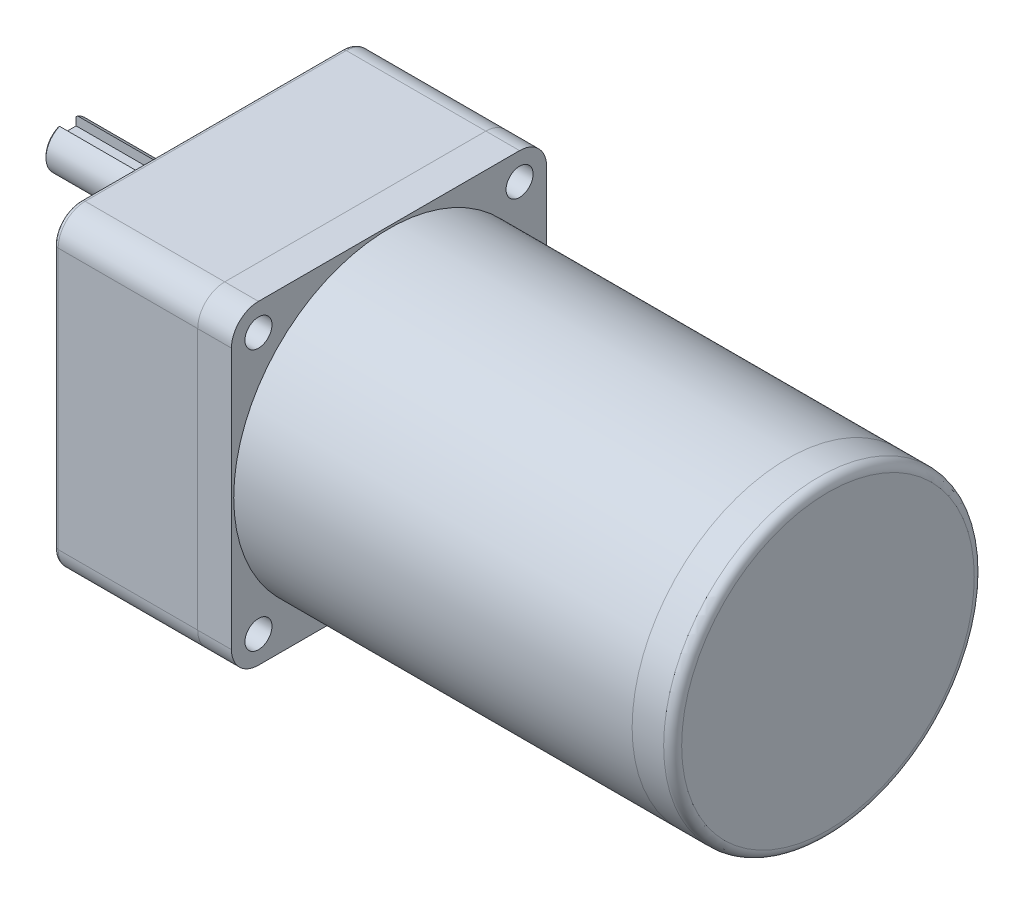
ISO-10303-21;
HEADER;
FILE_DESCRIPTION(('STEP AP214'),'2;1');
FILE_NAME('part.step','',(''),(''),'','','');
FILE_SCHEMA(('AUTOMOTIVE_DESIGN { 1 0 10303 214 1 1 1 1 }'));
ENDSEC;
DATA;
#1=APPLICATION_CONTEXT('core data for automotive mechanical design processes');
#2=APPLICATION_PROTOCOL_DEFINITION('international standard','automotive_design',2000,#1);
#3=PRODUCT_CONTEXT('',#1,'mechanical');
#4=PRODUCT('Part','Part','',(#3));
#5=PRODUCT_RELATED_PRODUCT_CATEGORY('part','',(#4));
#6=PRODUCT_DEFINITION_FORMATION('','',#4);
#7=PRODUCT_DEFINITION_CONTEXT('part definition',#1,'design');
#8=PRODUCT_DEFINITION('design','',#6,#7);
#9=PRODUCT_DEFINITION_SHAPE('','',#8);
#10=(LENGTH_UNIT() NAMED_UNIT(*) SI_UNIT(.MILLI.,.METRE.));
#11=(NAMED_UNIT(*) PLANE_ANGLE_UNIT() SI_UNIT($,.RADIAN.));
#12=(NAMED_UNIT(*) SI_UNIT($,.STERADIAN.) SOLID_ANGLE_UNIT());
#13=UNCERTAINTY_MEASURE_WITH_UNIT(LENGTH_MEASURE(1.E-05),#10,'distance_accuracy_value','');
#14=(GEOMETRIC_REPRESENTATION_CONTEXT(3) GLOBAL_UNCERTAINTY_ASSIGNED_CONTEXT((#13)) GLOBAL_UNIT_ASSIGNED_CONTEXT((#10,
#11,#12)) REPRESENTATION_CONTEXT('',''));
#15=CARTESIAN_POINT('',(0.,0.,0.));
#16=DIRECTION('',(0.,0.,1.));
#17=DIRECTION('',(1.,0.,0.));
#18=AXIS2_PLACEMENT_3D('',#15,#16,#17);
#19=CARTESIAN_POINT('',(137.,0.,0.));
#20=DIRECTION('',(-1.,0.,0.));
#21=DIRECTION('',(0.,0.,1.));
#22=AXIS2_PLACEMENT_3D('',#19,#20,#21);
#23=CYLINDRICAL_SURFACE('',#22,34.5);
#24=CARTESIAN_POINT('',(135.,0.,0.));
#25=DIRECTION('',(1.,0.,0.));
#26=DIRECTION('',(0.,0.,-1.));
#27=AXIS2_PLACEMENT_3D('',#24,#25,#26);
#28=CIRCLE('',#27,34.5);
#29=CARTESIAN_POINT('',(135.,0.,-34.5));
#30=VERTEX_POINT('',#29);
#31=EDGE_CURVE('E11',#30,#30,#28,.F.);
#32=ORIENTED_EDGE('',*,*,#31,.T.);
#33=EDGE_LOOP('',(#32));
#34=FACE_BOUND('',#33,.T.);
#35=CARTESIAN_POINT('',(128.,0.,0.));
#36=DIRECTION('',(1.,0.,0.));
#37=DIRECTION('',(0.,0.,-1.));
#38=AXIS2_PLACEMENT_3D('',#35,#36,#37);
#39=CIRCLE('',#38,34.5);
#40=CARTESIAN_POINT('',(128.,0.,-34.5));
#41=VERTEX_POINT('',#40);
#42=EDGE_CURVE('E55',#41,#41,#39,.T.);
#43=ORIENTED_EDGE('',*,*,#42,.T.);
#44=EDGE_LOOP('',(#43));
#45=FACE_BOUND('',#44,.T.);
#46=ADVANCED_FACE('F44',(#34,#45),#23,.T.);
#47=CARTESIAN_POINT('',(137.,0.,0.));
#48=DIRECTION('',(1.,0.,0.));
#49=DIRECTION('',(0.,0.,-1.));
#50=AXIS2_PLACEMENT_3D('',#47,#48,#49);
#51=PLANE('',#50);
#52=CARTESIAN_POINT('',(137.,0.,0.));
#53=DIRECTION('',(1.,0.,0.));
#54=DIRECTION('',(0.,0.,-1.));
#55=AXIS2_PLACEMENT_3D('',#52,#53,#54);
#56=CIRCLE('',#55,32.5);
#57=CARTESIAN_POINT('',(137.,0.,-32.5));
#58=VERTEX_POINT('',#57);
#59=EDGE_CURVE('E51',#58,#58,#56,.T.);
#60=ORIENTED_EDGE('',*,*,#59,.T.);
#61=EDGE_LOOP('',(#60));
#62=FACE_BOUND('',#61,.T.);
#63=ADVANCED_FACE('F65',(#62),#51,.T.);
#64=CARTESIAN_POINT('',(128.,0.,0.));
#65=DIRECTION('',(1.,0.,0.));
#66=DIRECTION('',(0.,0.,-1.));
#67=AXIS2_PLACEMENT_3D('',#64,#65,#66);
#68=PLANE('',#67);
#69=ORIENTED_EDGE('',*,*,#42,.F.);
#70=EDGE_LOOP('',(#69));
#71=FACE_BOUND('',#70,.T.);
#72=ADVANCED_FACE('F63',(#71),#68,.F.);
#73=CARTESIAN_POINT('',(135.,0.,0.));
#74=DIRECTION('',(1.,0.,0.));
#75=DIRECTION('',(0.,0.,-1.));
#76=AXIS2_PLACEMENT_3D('',#73,#74,#75);
#77=TOROIDAL_SURFACE('',#76,32.5,2.);
#78=ORIENTED_EDGE('',*,*,#31,.F.);
#79=EDGE_LOOP('',(#78));
#80=FACE_BOUND('',#79,.T.);
#81=ORIENTED_EDGE('',*,*,#59,.F.);
#82=EDGE_LOOP('',(#81));
#83=FACE_BOUND('',#82,.T.);
#84=ADVANCED_FACE('F46',(#80,#83),#77,.T.);
#85=CLOSED_SHELL('',(#46,#63,#72,#84));
#86=MANIFOLD_SOLID_BREP('B2',#85);
#87=CARTESIAN_POINT('',(128.,0.,0.));
#88=DIRECTION('',(-1.,0.,0.));
#89=DIRECTION('',(0.,0.,1.));
#90=AXIS2_PLACEMENT_3D('',#87,#88,#89);
#91=CYLINDRICAL_SURFACE('',#90,34.5);
#92=CARTESIAN_POINT('',(128.,0.,0.));
#93=DIRECTION('',(1.,0.,0.));
#94=DIRECTION('',(0.,0.,-1.));
#95=AXIS2_PLACEMENT_3D('',#92,#93,#94);
#96=CIRCLE('',#95,34.5);
#97=CARTESIAN_POINT('',(128.,0.,-34.5));
#98=VERTEX_POINT('',#97);
#99=EDGE_CURVE('E43',#98,#98,#96,.T.);
#100=ORIENTED_EDGE('',*,*,#99,.F.);
#101=EDGE_LOOP('',(#100));
#102=FACE_BOUND('',#101,.T.);
#103=CARTESIAN_POINT('',(39.5,0.,0.));
#104=DIRECTION('',(1.,0.,0.));
#105=DIRECTION('',(0.,0.,-1.));
#106=AXIS2_PLACEMENT_3D('',#103,#104,#105);
#107=CIRCLE('',#106,34.5);
#108=CARTESIAN_POINT('',(39.5,0.,-34.5));
#109=VERTEX_POINT('',#108);
#110=EDGE_CURVE('E113',#109,#109,#107,.T.);
#111=ORIENTED_EDGE('',*,*,#110,.T.);
#112=EDGE_LOOP('',(#111));
#113=FACE_BOUND('',#112,.T.);
#114=ADVANCED_FACE('F110',(#102,#113),#91,.T.);
#115=CARTESIAN_POINT('',(128.,0.,0.));
#116=DIRECTION('',(1.,0.,0.));
#117=DIRECTION('',(0.,0.,-1.));
#118=AXIS2_PLACEMENT_3D('',#115,#116,#117);
#119=PLANE('',#118);
#120=ORIENTED_EDGE('',*,*,#99,.T.);
#121=EDGE_LOOP('',(#120));
#122=FACE_BOUND('',#121,.T.);
#123=ADVANCED_FACE('F125',(#122),#119,.T.);
#124=CARTESIAN_POINT('',(39.5,0.,0.));
#125=DIRECTION('',(1.,0.,0.));
#126=DIRECTION('',(0.,0.,-1.));
#127=AXIS2_PLACEMENT_3D('',#124,#125,#126);
#128=PLANE('',#127);
#129=ORIENTED_EDGE('',*,*,#110,.F.);
#130=EDGE_LOOP('',(#129));
#131=FACE_BOUND('',#130,.T.);
#132=ADVANCED_FACE('F123',(#131),#128,.F.);
#133=CLOSED_SHELL('',(#114,#123,#132));
#134=MANIFOLD_SOLID_BREP('B6',#133);
#135=CARTESIAN_POINT('',(-32.,15.,0.));
#136=DIRECTION('',(1.,0.,0.));
#137=DIRECTION('',(0.,0.,-1.));
#138=AXIS2_PLACEMENT_3D('',#135,#136,#137);
#139=CYLINDRICAL_SURFACE('',#138,5.);
#140=DIRECTION('',(1.,0.,0.));
#141=VECTOR('',#140,1.);
#142=CARTESIAN_POINT('',(-32.,19.5825756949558,2.));
#143=LINE('',#142,#141);
#144=CARTESIAN_POINT('',(-9.,19.5825756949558,2.));
#145=VERTEX_POINT('',#144);
#146=CARTESIAN_POINT('',(-31.7,19.5825756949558,2.));
#147=VERTEX_POINT('',#146);
#148=EDGE_CURVE('E244',#145,#147,#143,.F.);
#149=ORIENTED_EDGE('',*,*,#148,.T.);
#150=CARTESIAN_POINT('',(-31.7,15.,0.));
#151=DIRECTION('',(-1.,0.,0.));
#152=DIRECTION('',(0.,0.,1.));
#153=AXIS2_PLACEMENT_3D('',#150,#151,#152);
#154=CIRCLE('',#153,5.);
#155=CARTESIAN_POINT('',(-31.7,19.5825756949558,-2.));
#156=VERTEX_POINT('',#155);
#157=EDGE_CURVE('E172',#147,#156,#154,.F.);
#158=ORIENTED_EDGE('',*,*,#157,.T.);
#159=DIRECTION('',(1.,0.,0.));
#160=VECTOR('',#159,1.);
#161=CARTESIAN_POINT('',(-32.,19.5825756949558,-2.));
#162=LINE('',#161,#160);
#163=CARTESIAN_POINT('',(-9.,19.5825756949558,-2.));
#164=VERTEX_POINT('',#163);
#165=EDGE_CURVE('E239',#156,#164,#162,.T.);
#166=ORIENTED_EDGE('',*,*,#165,.T.);
#167=CARTESIAN_POINT('',(-9.,19.5825756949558,-2.));
#168=CARTESIAN_POINT('',(-8.94619414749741,19.5825646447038,-2.00000798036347));
#169=CARTESIAN_POINT('',(-8.89239433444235,19.5835230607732,-1.99782891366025));
#170=CARTESIAN_POINT('',(-8.7852287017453,19.5872962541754,-1.98915905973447));
#171=CARTESIAN_POINT('',(-8.73186272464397,19.5901103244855,-1.98266991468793));
#172=CARTESIAN_POINT('',(-8.62615317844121,19.5974978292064,-1.9654760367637));
#173=CARTESIAN_POINT('',(-8.57380641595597,19.6020643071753,-1.95478796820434));
#174=CARTESIAN_POINT('',(-8.47029922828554,19.6128005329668,-1.92931630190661));
#175=CARTESIAN_POINT('',(-8.41913887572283,19.618970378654,-1.91453245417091));
#176=CARTESIAN_POINT('',(-8.26806414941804,19.6395929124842,-1.86426971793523));
#177=CARTESIAN_POINT('',(-8.17034576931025,19.6561744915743,-1.82284489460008));
#178=CARTESIAN_POINT('',(-7.98320441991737,19.6931237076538,-1.72548191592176));
#179=CARTESIAN_POINT('',(-7.89378944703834,19.7134949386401,-1.66952996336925));
#180=CARTESIAN_POINT('',(-7.72073760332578,19.7570099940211,-1.54131835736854));
#181=CARTESIAN_POINT('',(-7.63763278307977,19.7802424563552,-1.4683691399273));
#182=CARTESIAN_POINT('',(-7.48445972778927,19.8261279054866,-1.30969646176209));
#183=CARTESIAN_POINT('',(-7.41439416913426,19.8487807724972,-1.22397038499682));
#184=CARTESIAN_POINT('',(-7.28659360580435,19.8920341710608,-1.03800590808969));
#185=CARTESIAN_POINT('',(-7.22945519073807,19.9125182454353,-0.937327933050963));
#186=CARTESIAN_POINT('',(-7.13315592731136,19.94803944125,-0.726824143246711));
#187=CARTESIAN_POINT('',(-7.09398757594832,19.9630788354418,-0.617002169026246));
#188=CARTESIAN_POINT('',(-7.03665879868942,19.9853831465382,-0.396967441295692));
#189=CARTESIAN_POINT('',(-7.01757304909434,19.9929892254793,-0.287031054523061));
#190=CARTESIAN_POINT('',(-6.99797152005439,20.0008031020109,-0.0652684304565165));
#191=CARTESIAN_POINT('',(-6.99744916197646,20.0010135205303,0.0465571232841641));
#192=CARTESIAN_POINT('',(-7.01448283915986,19.994219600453,0.262233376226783));
#193=CARTESIAN_POINT('',(-7.03102504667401,19.9876198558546,0.36617920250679));
#194=CARTESIAN_POINT('',(-7.07999342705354,19.9684927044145,0.569674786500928));
#195=CARTESIAN_POINT('',(-7.11242049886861,19.9559649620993,0.669224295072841));
#196=CARTESIAN_POINT('',(-7.19263629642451,19.9259683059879,0.862897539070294));
#197=CARTESIAN_POINT('',(-7.24064924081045,19.9084277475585,0.956916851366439));
#198=CARTESIAN_POINT('',(-7.35046458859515,19.8701460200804,1.13580746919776));
#199=CARTESIAN_POINT('',(-7.41227182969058,19.8494037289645,1.22067554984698));
#200=CARTESIAN_POINT('',(-7.55264418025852,19.8052178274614,1.38476339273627));
#201=CARTESIAN_POINT('',(-7.63204247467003,19.7816862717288,1.46324770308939));
#202=CARTESIAN_POINT('',(-7.80298009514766,19.7356195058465,1.60609926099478));
#203=CARTESIAN_POINT('',(-7.89452492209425,19.7130847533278,1.67046007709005));
#204=CARTESIAN_POINT('',(-8.09047028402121,19.6709568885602,1.78493657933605));
#205=CARTESIAN_POINT('',(-8.1951648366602,19.6514670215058,1.83458932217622));
#206=CARTESIAN_POINT('',(-8.41236152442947,19.6188610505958,1.91521298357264));
#207=CARTESIAN_POINT('',(-8.52484944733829,19.6057336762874,1.94621696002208));
#208=CARTESIAN_POINT('',(-8.69874363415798,19.5920830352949,1.9781058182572));
#209=CARTESIAN_POINT('',(-8.75865754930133,19.5885343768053,1.98630505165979));
#210=CARTESIAN_POINT('',(-8.87903501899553,19.5837754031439,1.99725282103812));
#211=CARTESIAN_POINT('',(-8.93949821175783,19.5825636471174,2.00000471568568));
#212=CARTESIAN_POINT('',(-9.,19.5825756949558,2.));
#213=B_SPLINE_CURVE_WITH_KNOTS('',3,(#167,#168,#169,#170,#171,#172,#173,#174,#175,#176,#177,
#178,#179,#180,#181,#182,#183,#184,#185,#186,#187,#188,#189,#190,#191,#192,#193,#194,#195,#196,
#197,#198,#199,#200,#201,#202,#203,#204,#205,#206,#207,#208,#209,#210,#211,#212),.UNSPECIFIED.,
.F.,.F.,(4,2,2,2,2,2,2,2,2,2,2,2,2,2,2,2,2,2,2,2,2,2,4),(0.,0.161354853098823,0.322648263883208,
0.483307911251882,0.643977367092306,0.964683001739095,1.28569434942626,1.62318047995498,
1.96073580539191,2.31162858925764,2.66237473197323,2.9961387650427,3.32978451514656,
3.64468915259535,3.95961161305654,4.27928176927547,4.59906421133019,4.93981874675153,
5.28072813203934,5.63144241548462,5.98153315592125,6.16300192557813,6.3443587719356),.UNSPECIFIED.);
#214=EDGE_CURVE('E218',#164,#145,#213,.T.);
#215=ORIENTED_EDGE('',*,*,#214,.T.);
#216=EDGE_LOOP('',(#149,#158,#166,#215));
#217=FACE_BOUND('',#216,.T.);
#218=CARTESIAN_POINT('',(-3.,15.,0.));
#219=DIRECTION('',(-1.,0.,0.));
#220=DIRECTION('',(0.,0.,1.));
#221=AXIS2_PLACEMENT_3D('',#218,#219,#220);
#222=CIRCLE('',#221,5.);
#223=CARTESIAN_POINT('',(-3.,15.,5.));
#224=VERTEX_POINT('',#223);
#225=EDGE_CURVE('E246',#224,#224,#222,.T.);
#226=ORIENTED_EDGE('',*,*,#225,.T.);
#227=EDGE_LOOP('',(#226));
#228=FACE_BOUND('',#227,.T.);
#229=ADVANCED_FACE('F159',(#217,#228),#139,.T.);
#230=CARTESIAN_POINT('',(-32.,15.,0.));
#231=DIRECTION('',(-1.,0.,0.));
#232=DIRECTION('',(0.,0.,1.));
#233=AXIS2_PLACEMENT_3D('',#230,#231,#232);
#234=PLANE('',#233);
#235=DIRECTION('',(0.,1.,0.));
#236=VECTOR('',#235,1.);
#237=CARTESIAN_POINT('',(-32.,17.5,-2.));
#238=LINE('',#237,#236);
#239=CARTESIAN_POINT('',(-32.,17.5,-2.));
#240=VERTEX_POINT('',#239);
#241=CARTESIAN_POINT('',(-32.,19.2532340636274,-2.));
#242=VERTEX_POINT('',#241);
#243=EDGE_CURVE('E220',#240,#242,#238,.T.);
#244=ORIENTED_EDGE('',*,*,#243,.T.);
#245=CARTESIAN_POINT('',(-32.,15.,0.));
#246=DIRECTION('',(-1.,0.,0.));
#247=DIRECTION('',(0.,0.,1.));
#248=AXIS2_PLACEMENT_3D('',#245,#246,#247);
#249=CIRCLE('',#248,4.70000000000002);
#250=CARTESIAN_POINT('',(-32.,19.2532340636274,2.));
#251=VERTEX_POINT('',#250);
#252=EDGE_CURVE('E254',#242,#251,#249,.T.);
#253=ORIENTED_EDGE('',*,*,#252,.T.);
#254=DIRECTION('',(0.,1.,0.));
#255=VECTOR('',#254,1.);
#256=CARTESIAN_POINT('',(-32.,17.5,2.));
#257=LINE('',#256,#255);
#258=CARTESIAN_POINT('',(-32.,17.5,2.));
#259=VERTEX_POINT('',#258);
#260=EDGE_CURVE('E240',#259,#251,#257,.T.);
#261=ORIENTED_EDGE('',*,*,#260,.F.);
#262=DIRECTION('',(0.,0.,1.));
#263=VECTOR('',#262,1.);
#264=CARTESIAN_POINT('',(-32.,17.5,-2.));
#265=LINE('',#264,#263);
#266=EDGE_CURVE('E229',#240,#259,#265,.T.);
#267=ORIENTED_EDGE('',*,*,#266,.F.);
#268=EDGE_LOOP('',(#244,#253,#261,#267));
#269=FACE_BOUND('',#268,.T.);
#270=ADVANCED_FACE('F265',(#269),#234,.T.);
#271=CARTESIAN_POINT('',(-3.,15.,0.));
#272=DIRECTION('',(-1.,0.,0.));
#273=DIRECTION('',(0.,0.,1.));
#274=AXIS2_PLACEMENT_3D('',#271,#272,#273);
#275=PLANE('',#274);
#276=ORIENTED_EDGE('',*,*,#225,.F.);
#277=EDGE_LOOP('',(#276));
#278=FACE_BOUND('',#277,.T.);
#279=ADVANCED_FACE('F262',(#278),#275,.F.);
#280=CARTESIAN_POINT('',(-9.,17.5,0.));
#281=DIRECTION('',(0.,1.,0.));
#282=DIRECTION('',(0.,0.,1.));
#283=AXIS2_PLACEMENT_3D('',#280,#281,#282);
#284=CYLINDRICAL_SURFACE('',#283,2.);
#285=DIRECTION('',(0.,1.,0.));
#286=VECTOR('',#285,1.);
#287=CARTESIAN_POINT('',(-9.,17.5,-2.));
#288=LINE('',#287,#286);
#289=CARTESIAN_POINT('',(-9.,17.5,-2.));
#290=VERTEX_POINT('',#289);
#291=EDGE_CURVE('E210',#290,#164,#288,.T.);
#292=ORIENTED_EDGE('',*,*,#291,.F.);
#293=CARTESIAN_POINT('',(-9.,17.5,0.));
#294=DIRECTION('',(0.,1.,0.));
#295=DIRECTION('',(0.,0.,1.));
#296=AXIS2_PLACEMENT_3D('',#293,#294,#295);
#297=CIRCLE('',#296,2.);
#298=CARTESIAN_POINT('',(-9.,17.5,2.));
#299=VERTEX_POINT('',#298);
#300=EDGE_CURVE('E215',#299,#290,#297,.T.);
#301=ORIENTED_EDGE('',*,*,#300,.F.);
#302=DIRECTION('',(0.,1.,0.));
#303=VECTOR('',#302,1.);
#304=CARTESIAN_POINT('',(-9.,17.5,2.));
#305=LINE('',#304,#303);
#306=EDGE_CURVE('E237',#299,#145,#305,.T.);
#307=ORIENTED_EDGE('',*,*,#306,.T.);
#308=ORIENTED_EDGE('',*,*,#214,.F.);
#309=EDGE_LOOP('',(#292,#301,#307,#308));
#310=FACE_BOUND('',#309,.T.);
#311=ADVANCED_FACE('F212',(#310),#284,.F.);
#312=CARTESIAN_POINT('',(-32.,17.5,2.));
#313=DIRECTION('',(0.,0.,1.));
#314=DIRECTION('',(1.,0.,0.));
#315=AXIS2_PLACEMENT_3D('',#312,#313,#314);
#316=PLANE('',#315);
#317=ORIENTED_EDGE('',*,*,#260,.T.);
#318=CARTESIAN_POINT('',(-32.,19.2532340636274,2.));
#319=CARTESIAN_POINT('',(-31.950173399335,19.3082822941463,2.));
#320=CARTESIAN_POINT('',(-31.9002600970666,19.3632515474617,2.));
#321=CARTESIAN_POINT('',(-31.8002600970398,19.4730320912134,2.));
#322=CARTESIAN_POINT('',(-31.7501733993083,19.5278433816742,2.));
#323=CARTESIAN_POINT('',(-31.7,19.5825756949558,2.));
#324=B_SPLINE_CURVE_WITH_KNOTS('',3,(#318,#319,#320,#321,#322,#323),.UNSPECIFIED.,.F.,.F.,(4,2,
4),(0.,0.22274785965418,0.445495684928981),.UNSPECIFIED.);
#325=EDGE_CURVE('E186',#251,#147,#324,.T.);
#326=ORIENTED_EDGE('',*,*,#325,.T.);
#327=ORIENTED_EDGE('',*,*,#148,.F.);
#328=ORIENTED_EDGE('',*,*,#306,.F.);
#329=DIRECTION('',(1.,0.,0.));
#330=VECTOR('',#329,1.);
#331=CARTESIAN_POINT('',(-32.,17.5,2.));
#332=LINE('',#331,#330);
#333=EDGE_CURVE('E221',#259,#299,#332,.T.);
#334=ORIENTED_EDGE('',*,*,#333,.F.);
#335=EDGE_LOOP('',(#317,#326,#327,#328,#334));
#336=FACE_BOUND('',#335,.T.);
#337=ADVANCED_FACE('F261',(#336),#316,.F.);
#338=CARTESIAN_POINT('',(-9.,17.5,-2.));
#339=DIRECTION('',(0.,0.,-1.));
#340=DIRECTION('',(-1.,0.,0.));
#341=AXIS2_PLACEMENT_3D('',#338,#339,#340);
#342=PLANE('',#341);
#343=ORIENTED_EDGE('',*,*,#165,.F.);
#344=CARTESIAN_POINT('',(-31.7,19.5825756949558,-2.));
#345=CARTESIAN_POINT('',(-31.7501733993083,19.5278433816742,-2.));
#346=CARTESIAN_POINT('',(-31.8002600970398,19.4730320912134,-2.));
#347=CARTESIAN_POINT('',(-31.9002600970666,19.3632515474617,-2.));
#348=CARTESIAN_POINT('',(-31.950173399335,19.3082822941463,-2.));
#349=CARTESIAN_POINT('',(-32.,19.2532340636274,-2.));
#350=B_SPLINE_CURVE_WITH_KNOTS('',3,(#344,#345,#346,#347,#348,#349),.UNSPECIFIED.,.F.,.F.,(4,2,
4),(0.,0.2227478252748,0.445495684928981),.UNSPECIFIED.);
#351=EDGE_CURVE('E108',#156,#242,#350,.T.);
#352=ORIENTED_EDGE('',*,*,#351,.T.);
#353=ORIENTED_EDGE('',*,*,#243,.F.);
#354=DIRECTION('',(-1.,0.,0.));
#355=VECTOR('',#354,1.);
#356=CARTESIAN_POINT('',(-9.,17.5,-2.));
#357=LINE('',#356,#355);
#358=EDGE_CURVE('E224',#290,#240,#357,.T.);
#359=ORIENTED_EDGE('',*,*,#358,.F.);
#360=ORIENTED_EDGE('',*,*,#291,.T.);
#361=EDGE_LOOP('',(#343,#352,#353,#359,#360));
#362=FACE_BOUND('',#361,.T.);
#363=ADVANCED_FACE('F225',(#362),#342,.F.);
#364=CARTESIAN_POINT('',(-9.,17.5,0.));
#365=DIRECTION('',(0.,1.,0.));
#366=DIRECTION('',(0.,0.,1.));
#367=AXIS2_PLACEMENT_3D('',#364,#365,#366);
#368=PLANE('',#367);
#369=ORIENTED_EDGE('',*,*,#300,.T.);
#370=ORIENTED_EDGE('',*,*,#358,.T.);
#371=ORIENTED_EDGE('',*,*,#266,.T.);
#372=ORIENTED_EDGE('',*,*,#333,.T.);
#373=EDGE_LOOP('',(#369,#370,#371,#372));
#374=FACE_BOUND('',#373,.T.);
#375=ADVANCED_FACE('F231',(#374),#368,.T.);
#376=CARTESIAN_POINT('',(-32.,15.,0.));
#377=DIRECTION('',(1.,0.,0.));
#378=DIRECTION('',(0.,0.,-1.));
#379=AXIS2_PLACEMENT_3D('',#376,#377,#378);
#380=CONICAL_SURFACE('',#379,4.70000000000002,0.78539816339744);
#381=ORIENTED_EDGE('',*,*,#351,.F.);
#382=ORIENTED_EDGE('',*,*,#157,.F.);
#383=ORIENTED_EDGE('',*,*,#325,.F.);
#384=ORIENTED_EDGE('',*,*,#252,.F.);
#385=EDGE_LOOP('',(#381,#382,#383,#384));
#386=FACE_BOUND('',#385,.T.);
#387=ADVANCED_FACE('F161',(#386),#380,.T.);
#388=CLOSED_SHELL('',(#229,#270,#279,#311,#337,#363,#375,#387));
#389=MANIFOLD_SOLID_BREP('B38',#388);
#390=CARTESIAN_POINT('',(-3.,15.,0.));
#391=DIRECTION('',(1.,0.,0.));
#392=DIRECTION('',(0.,0.,-1.));
#393=AXIS2_PLACEMENT_3D('',#390,#391,#392);
#394=CYLINDRICAL_SURFACE('',#393,12.);
#395=CARTESIAN_POINT('',(-2.5,15.,0.));
#396=DIRECTION('',(-1.,0.,0.));
#397=DIRECTION('',(0.,0.,1.));
#398=AXIS2_PLACEMENT_3D('',#395,#396,#397);
#399=CIRCLE('',#398,12.);
#400=CARTESIAN_POINT('',(-2.5,15.,12.));
#401=VERTEX_POINT('',#400);
#402=EDGE_CURVE('E158',#401,#401,#399,.F.);
#403=ORIENTED_EDGE('',*,*,#402,.T.);
#404=EDGE_LOOP('',(#403));
#405=FACE_BOUND('',#404,.T.);
#406=CARTESIAN_POINT('',(0.,15.,0.));
#407=DIRECTION('',(-1.,0.,0.));
#408=DIRECTION('',(0.,0.,1.));
#409=AXIS2_PLACEMENT_3D('',#406,#407,#408);
#410=CIRCLE('',#409,12.);
#411=CARTESIAN_POINT('',(0.,15.,12.));
#412=VERTEX_POINT('',#411);
#413=EDGE_CURVE('E360',#412,#412,#410,.T.);
#414=ORIENTED_EDGE('',*,*,#413,.T.);
#415=EDGE_LOOP('',(#414));
#416=FACE_BOUND('',#415,.T.);
#417=ADVANCED_FACE('F349',(#405,#416),#394,.T.);
#418=CARTESIAN_POINT('',(-3.,15.,0.));
#419=DIRECTION('',(-1.,0.,0.));
#420=DIRECTION('',(0.,0.,1.));
#421=AXIS2_PLACEMENT_3D('',#418,#419,#420);
#422=PLANE('',#421);
#423=CARTESIAN_POINT('',(-3.,15.,0.));
#424=DIRECTION('',(-1.,0.,0.));
#425=DIRECTION('',(0.,0.,1.));
#426=AXIS2_PLACEMENT_3D('',#423,#424,#425);
#427=CIRCLE('',#426,11.5);
#428=CARTESIAN_POINT('',(-3.,15.,11.5));
#429=VERTEX_POINT('',#428);
#430=EDGE_CURVE('E356',#429,#429,#427,.T.);
#431=ORIENTED_EDGE('',*,*,#430,.T.);
#432=EDGE_LOOP('',(#431));
#433=FACE_BOUND('',#432,.T.);
#434=ADVANCED_FACE('F370',(#433),#422,.T.);
#435=CARTESIAN_POINT('',(0.,15.,0.));
#436=DIRECTION('',(-1.,0.,0.));
#437=DIRECTION('',(0.,0.,1.));
#438=AXIS2_PLACEMENT_3D('',#435,#436,#437);
#439=PLANE('',#438);
#440=ORIENTED_EDGE('',*,*,#413,.F.);
#441=EDGE_LOOP('',(#440));
#442=FACE_BOUND('',#441,.T.);
#443=ADVANCED_FACE('F368',(#442),#439,.F.);
#444=CARTESIAN_POINT('',(-2.5,15.,0.));
#445=DIRECTION('',(-1.,0.,0.));
#446=DIRECTION('',(0.,0.,1.));
#447=AXIS2_PLACEMENT_3D('',#444,#445,#446);
#448=TOROIDAL_SURFACE('',#447,11.5,0.5);
#449=ORIENTED_EDGE('',*,*,#402,.F.);
#450=EDGE_LOOP('',(#449));
#451=FACE_BOUND('',#450,.T.);
#452=ORIENTED_EDGE('',*,*,#430,.F.);
#453=EDGE_LOOP('',(#452));
#454=FACE_BOUND('',#453,.T.);
#455=ADVANCED_FACE('F351',(#451,#454),#448,.T.);
#456=CLOSED_SHELL('',(#417,#434,#443,#455));
#457=MANIFOLD_SOLID_BREP('B102',#456);
#458=CARTESIAN_POINT('',(39.5,29.,-29.));
#459=DIRECTION('',(-1.,0.,0.));
#460=DIRECTION('',(0.,0.,1.));
#461=AXIS2_PLACEMENT_3D('',#458,#459,#460);
#462=CYLINDRICAL_SURFACE('',#461,6.);
#463=CARTESIAN_POINT('',(32.,29.,-29.));
#464=DIRECTION('',(1.,0.,0.));
#465=DIRECTION('',(0.,0.,1.));
#466=AXIS2_PLACEMENT_3D('',#463,#464,#465);
#467=CIRCLE('',#466,6.);
#468=CARTESIAN_POINT('',(32.,29.,-35.));
#469=VERTEX_POINT('',#468);
#470=CARTESIAN_POINT('',(32.,35.,-29.));
#471=VERTEX_POINT('',#470);
#472=EDGE_CURVE('E512',#469,#471,#467,.T.);
#473=ORIENTED_EDGE('',*,*,#472,.T.);
#474=DIRECTION('',(-1.,0.,0.));
#475=VECTOR('',#474,1.);
#476=CARTESIAN_POINT('',(39.5,35.,-29.));
#477=LINE('',#476,#475);
#478=CARTESIAN_POINT('',(39.5,35.,-29.));
#479=VERTEX_POINT('',#478);
#480=EDGE_CURVE('E347',#479,#471,#477,.T.);
#481=ORIENTED_EDGE('',*,*,#480,.F.);
#482=CARTESIAN_POINT('',(39.5,29.,-29.));
#483=DIRECTION('',(1.,0.,0.));
#484=DIRECTION('',(0.,0.,1.));
#485=AXIS2_PLACEMENT_3D('',#482,#483,#484);
#486=CIRCLE('',#485,6.);
#487=CARTESIAN_POINT('',(39.5,29.,-35.));
#488=VERTEX_POINT('',#487);
#489=EDGE_CURVE('E526',#488,#479,#486,.T.);
#490=ORIENTED_EDGE('',*,*,#489,.F.);
#491=DIRECTION('',(-1.,0.,0.));
#492=VECTOR('',#491,1.);
#493=CARTESIAN_POINT('',(39.5,29.,-35.));
#494=LINE('',#493,#492);
#495=EDGE_CURVE('E508',#488,#469,#494,.T.);
#496=ORIENTED_EDGE('',*,*,#495,.T.);
#497=EDGE_LOOP('',(#473,#481,#490,#496));
#498=FACE_BOUND('',#497,.T.);
#499=ADVANCED_FACE('F414',(#498),#462,.T.);
#500=CARTESIAN_POINT('',(39.5,35.,29.));
#501=DIRECTION('',(0.,-1.,0.));
#502=DIRECTION('',(0.,0.,-1.));
#503=AXIS2_PLACEMENT_3D('',#500,#501,#502);
#504=PLANE('',#503);
#505=DIRECTION('',(0.,0.,1.));
#506=VECTOR('',#505,1.);
#507=CARTESIAN_POINT('',(32.,35.,29.));
#508=LINE('',#507,#506);
#509=CARTESIAN_POINT('',(32.,35.,29.));
#510=VERTEX_POINT('',#509);
#511=EDGE_CURVE('E515',#471,#510,#508,.T.);
#512=ORIENTED_EDGE('',*,*,#511,.T.);
#513=DIRECTION('',(-1.,0.,0.));
#514=VECTOR('',#513,1.);
#515=CARTESIAN_POINT('',(39.5,35.,29.));
#516=LINE('',#515,#514);
#517=CARTESIAN_POINT('',(39.5,35.,29.));
#518=VERTEX_POINT('',#517);
#519=EDGE_CURVE('E423',#518,#510,#516,.T.);
#520=ORIENTED_EDGE('',*,*,#519,.F.);
#521=DIRECTION('',(0.,0.,1.));
#522=VECTOR('',#521,1.);
#523=CARTESIAN_POINT('',(39.5,35.,29.));
#524=LINE('',#523,#522);
#525=EDGE_CURVE('E475',#479,#518,#524,.T.);
#526=ORIENTED_EDGE('',*,*,#525,.F.);
#527=ORIENTED_EDGE('',*,*,#480,.T.);
#528=EDGE_LOOP('',(#512,#520,#526,#527));
#529=FACE_BOUND('',#528,.T.);
#530=ADVANCED_FACE('F580',(#529),#504,.F.);
#531=CARTESIAN_POINT('',(39.5,29.,29.));
#532=DIRECTION('',(-1.,0.,0.));
#533=DIRECTION('',(0.,0.,1.));
#534=AXIS2_PLACEMENT_3D('',#531,#532,#533);
#535=CYLINDRICAL_SURFACE('',#534,6.);
#536=CARTESIAN_POINT('',(32.,29.,29.));
#537=DIRECTION('',(1.,0.,0.));
#538=DIRECTION('',(0.,0.,1.));
#539=AXIS2_PLACEMENT_3D('',#536,#537,#538);
#540=CIRCLE('',#539,6.);
#541=CARTESIAN_POINT('',(32.,29.,35.));
#542=VERTEX_POINT('',#541);
#543=EDGE_CURVE('E517',#510,#542,#540,.T.);
#544=ORIENTED_EDGE('',*,*,#543,.T.);
#545=DIRECTION('',(-1.,0.,0.));
#546=VECTOR('',#545,1.);
#547=CARTESIAN_POINT('',(39.5,29.,35.));
#548=LINE('',#547,#546);
#549=CARTESIAN_POINT('',(39.5,29.,35.));
#550=VERTEX_POINT('',#549);
#551=EDGE_CURVE('E533',#550,#542,#548,.T.);
#552=ORIENTED_EDGE('',*,*,#551,.F.);
#553=CARTESIAN_POINT('',(39.5,29.,29.));
#554=DIRECTION('',(1.,0.,0.));
#555=DIRECTION('',(0.,0.,1.));
#556=AXIS2_PLACEMENT_3D('',#553,#554,#555);
#557=CIRCLE('',#556,6.);
#558=EDGE_CURVE('E681',#518,#550,#557,.T.);
#559=ORIENTED_EDGE('',*,*,#558,.F.);
#560=ORIENTED_EDGE('',*,*,#519,.T.);
#561=EDGE_LOOP('',(#544,#552,#559,#560));
#562=FACE_BOUND('',#561,.T.);
#563=ADVANCED_FACE('F584',(#562),#535,.T.);
#564=CARTESIAN_POINT('',(39.5,-29.,35.));
#565=DIRECTION('',(0.,0.,-1.));
#566=DIRECTION('',(-1.,0.,0.));
#567=AXIS2_PLACEMENT_3D('',#564,#565,#566);
#568=PLANE('',#567);
#569=DIRECTION('',(0.,-1.,0.));
#570=VECTOR('',#569,1.);
#571=CARTESIAN_POINT('',(32.,-29.,35.));
#572=LINE('',#571,#570);
#573=CARTESIAN_POINT('',(32.,-29.,35.));
#574=VERTEX_POINT('',#573);
#575=EDGE_CURVE('E519',#542,#574,#572,.T.);
#576=ORIENTED_EDGE('',*,*,#575,.T.);
#577=DIRECTION('',(-1.,0.,0.));
#578=VECTOR('',#577,1.);
#579=CARTESIAN_POINT('',(39.5,-29.,35.));
#580=LINE('',#579,#578);
#581=CARTESIAN_POINT('',(39.5,-29.,35.));
#582=VERTEX_POINT('',#581);
#583=EDGE_CURVE('E530',#582,#574,#580,.T.);
#584=ORIENTED_EDGE('',*,*,#583,.F.);
#585=DIRECTION('',(0.,-1.,0.));
#586=VECTOR('',#585,1.);
#587=CARTESIAN_POINT('',(39.5,-29.,35.));
#588=LINE('',#587,#586);
#589=EDGE_CURVE('E683',#550,#582,#588,.T.);
#590=ORIENTED_EDGE('',*,*,#589,.F.);
#591=ORIENTED_EDGE('',*,*,#551,.T.);
#592=EDGE_LOOP('',(#576,#584,#590,#591));
#593=FACE_BOUND('',#592,.T.);
#594=ADVANCED_FACE('F588',(#593),#568,.F.);
#595=CARTESIAN_POINT('',(39.5,-29.,29.));
#596=DIRECTION('',(-1.,0.,0.));
#597=DIRECTION('',(0.,0.,1.));
#598=AXIS2_PLACEMENT_3D('',#595,#596,#597);
#599=CYLINDRICAL_SURFACE('',#598,6.);
#600=CARTESIAN_POINT('',(32.,-29.,29.));
#601=DIRECTION('',(1.,0.,0.));
#602=DIRECTION('',(0.,0.,1.));
#603=AXIS2_PLACEMENT_3D('',#600,#601,#602);
#604=CIRCLE('',#603,6.);
#605=CARTESIAN_POINT('',(32.,-35.,29.));
#606=VERTEX_POINT('',#605);
#607=EDGE_CURVE('E521',#574,#606,#604,.T.);
#608=ORIENTED_EDGE('',*,*,#607,.T.);
#609=DIRECTION('',(-1.,0.,0.));
#610=VECTOR('',#609,1.);
#611=CARTESIAN_POINT('',(39.5,-35.,29.));
#612=LINE('',#611,#610);
#613=CARTESIAN_POINT('',(39.5,-35.,29.));
#614=VERTEX_POINT('',#613);
#615=EDGE_CURVE('E503',#614,#606,#612,.T.);
#616=ORIENTED_EDGE('',*,*,#615,.F.);
#617=CARTESIAN_POINT('',(39.5,-29.,29.));
#618=DIRECTION('',(1.,0.,0.));
#619=DIRECTION('',(0.,0.,1.));
#620=AXIS2_PLACEMENT_3D('',#617,#618,#619);
#621=CIRCLE('',#620,6.);
#622=EDGE_CURVE('E494',#582,#614,#621,.T.);
#623=ORIENTED_EDGE('',*,*,#622,.F.);
#624=ORIENTED_EDGE('',*,*,#583,.T.);
#625=EDGE_LOOP('',(#608,#616,#623,#624));
#626=FACE_BOUND('',#625,.T.);
#627=ADVANCED_FACE('F594',(#626),#599,.T.);
#628=CARTESIAN_POINT('',(39.5,-35.,29.));
#629=DIRECTION('',(0.,1.,0.));
#630=DIRECTION('',(0.,0.,1.));
#631=AXIS2_PLACEMENT_3D('',#628,#629,#630);
#632=PLANE('',#631);
#633=DIRECTION('',(0.,0.,-1.));
#634=VECTOR('',#633,1.);
#635=CARTESIAN_POINT('',(32.,-35.,29.));
#636=LINE('',#635,#634);
#637=CARTESIAN_POINT('',(32.,-35.,-29.));
#638=VERTEX_POINT('',#637);
#639=EDGE_CURVE('E502',#606,#638,#636,.T.);
#640=ORIENTED_EDGE('',*,*,#639,.T.);
#641=DIRECTION('',(-1.,0.,0.));
#642=VECTOR('',#641,1.);
#643=CARTESIAN_POINT('',(39.5,-35.,-29.));
#644=LINE('',#643,#642);
#645=CARTESIAN_POINT('',(39.5,-35.,-29.));
#646=VERTEX_POINT('',#645);
#647=EDGE_CURVE('E499',#646,#638,#644,.T.);
#648=ORIENTED_EDGE('',*,*,#647,.F.);
#649=DIRECTION('',(0.,0.,-1.));
#650=VECTOR('',#649,1.);
#651=CARTESIAN_POINT('',(39.5,-35.,29.));
#652=LINE('',#651,#650);
#653=EDGE_CURVE('E488',#614,#646,#652,.T.);
#654=ORIENTED_EDGE('',*,*,#653,.F.);
#655=ORIENTED_EDGE('',*,*,#615,.T.);
#656=EDGE_LOOP('',(#640,#648,#654,#655));
#657=FACE_BOUND('',#656,.T.);
#658=ADVANCED_FACE('F500',(#657),#632,.F.);
#659=CARTESIAN_POINT('',(39.5,-29.,-29.));
#660=DIRECTION('',(-1.,0.,0.));
#661=DIRECTION('',(0.,0.,1.));
#662=AXIS2_PLACEMENT_3D('',#659,#660,#661);
#663=CYLINDRICAL_SURFACE('',#662,6.);
#664=CARTESIAN_POINT('',(32.,-29.,-29.));
#665=DIRECTION('',(1.,0.,0.));
#666=DIRECTION('',(0.,0.,-1.));
#667=AXIS2_PLACEMENT_3D('',#664,#665,#666);
#668=CIRCLE('',#667,6.);
#669=CARTESIAN_POINT('',(32.,-29.,-35.));
#670=VERTEX_POINT('',#669);
#671=EDGE_CURVE('E461',#638,#670,#668,.T.);
#672=ORIENTED_EDGE('',*,*,#671,.T.);
#673=DIRECTION('',(-1.,0.,0.));
#674=VECTOR('',#673,1.);
#675=CARTESIAN_POINT('',(39.5,-29.,-35.));
#676=LINE('',#675,#674);
#677=CARTESIAN_POINT('',(39.5,-29.,-35.));
#678=VERTEX_POINT('',#677);
#679=EDGE_CURVE('E504',#678,#670,#676,.T.);
#680=ORIENTED_EDGE('',*,*,#679,.F.);
#681=CARTESIAN_POINT('',(39.5,-29.,-29.));
#682=DIRECTION('',(1.,0.,0.));
#683=DIRECTION('',(0.,0.,-1.));
#684=AXIS2_PLACEMENT_3D('',#681,#682,#683);
#685=CIRCLE('',#684,6.);
#686=EDGE_CURVE('E492',#646,#678,#685,.T.);
#687=ORIENTED_EDGE('',*,*,#686,.F.);
#688=ORIENTED_EDGE('',*,*,#647,.T.);
#689=EDGE_LOOP('',(#672,#680,#687,#688));
#690=FACE_BOUND('',#689,.T.);
#691=ADVANCED_FACE('F506',(#690),#663,.T.);
#692=CARTESIAN_POINT('',(39.5,-29.,-35.));
#693=DIRECTION('',(0.,0.,1.));
#694=DIRECTION('',(1.,0.,0.));
#695=AXIS2_PLACEMENT_3D('',#692,#693,#694);
#696=PLANE('',#695);
#697=DIRECTION('',(0.,1.,0.));
#698=VECTOR('',#697,1.);
#699=CARTESIAN_POINT('',(32.,-29.,-35.));
#700=LINE('',#699,#698);
#701=EDGE_CURVE('E467',#670,#469,#700,.T.);
#702=ORIENTED_EDGE('',*,*,#701,.T.);
#703=ORIENTED_EDGE('',*,*,#495,.F.);
#704=DIRECTION('',(0.,1.,0.));
#705=VECTOR('',#704,1.);
#706=CARTESIAN_POINT('',(39.5,-29.,-35.));
#707=LINE('',#706,#705);
#708=EDGE_CURVE('E432',#678,#488,#707,.T.);
#709=ORIENTED_EDGE('',*,*,#708,.F.);
#710=ORIENTED_EDGE('',*,*,#679,.T.);
#711=EDGE_LOOP('',(#702,#703,#709,#710));
#712=FACE_BOUND('',#711,.T.);
#713=ADVANCED_FACE('F569',(#712),#696,.F.);
#714=CARTESIAN_POINT('',(39.5,29.,-29.));
#715=DIRECTION('',(-1.,0.,0.));
#716=DIRECTION('',(0.,0.,1.));
#717=AXIS2_PLACEMENT_3D('',#714,#715,#716);
#718=PLANE('',#717);
#719=CARTESIAN_POINT('',(39.5,29.,29.));
#720=DIRECTION('',(1.,0.,0.));
#721=DIRECTION('',(0.,0.,-1.));
#722=AXIS2_PLACEMENT_3D('',#719,#720,#721);
#723=CIRCLE('',#722,3.);
#724=CARTESIAN_POINT('',(39.5,29.,26.));
#725=VERTEX_POINT('',#724);
#726=EDGE_CURVE('E542',#725,#725,#723,.T.);
#727=ORIENTED_EDGE('',*,*,#726,.F.);
#728=EDGE_LOOP('',(#727));
#729=FACE_BOUND('',#728,.T.);
#730=CARTESIAN_POINT('',(39.5,29.,-29.));
#731=DIRECTION('',(1.,0.,0.));
#732=DIRECTION('',(0.,0.,-1.));
#733=AXIS2_PLACEMENT_3D('',#730,#731,#732);
#734=CIRCLE('',#733,3.);
#735=CARTESIAN_POINT('',(39.5,29.,-32.));
#736=VERTEX_POINT('',#735);
#737=EDGE_CURVE('E667',#736,#736,#734,.T.);
#738=ORIENTED_EDGE('',*,*,#737,.F.);
#739=EDGE_LOOP('',(#738));
#740=FACE_BOUND('',#739,.T.);
#741=CARTESIAN_POINT('',(39.5,-29.,-29.));
#742=DIRECTION('',(1.,0.,0.));
#743=DIRECTION('',(0.,0.,-1.));
#744=AXIS2_PLACEMENT_3D('',#741,#742,#743);
#745=CIRCLE('',#744,3.);
#746=CARTESIAN_POINT('',(39.5,-29.,-32.));
#747=VERTEX_POINT('',#746);
#748=EDGE_CURVE('E669',#747,#747,#745,.T.);
#749=ORIENTED_EDGE('',*,*,#748,.F.);
#750=EDGE_LOOP('',(#749));
#751=FACE_BOUND('',#750,.T.);
#752=CARTESIAN_POINT('',(39.5,-29.,29.));
#753=DIRECTION('',(1.,0.,0.));
#754=DIRECTION('',(0.,0.,-1.));
#755=AXIS2_PLACEMENT_3D('',#752,#753,#754);
#756=CIRCLE('',#755,3.);
#757=CARTESIAN_POINT('',(39.5,-29.,26.));
#758=VERTEX_POINT('',#757);
#759=EDGE_CURVE('E674',#758,#758,#756,.T.);
#760=ORIENTED_EDGE('',*,*,#759,.F.);
#761=EDGE_LOOP('',(#760));
#762=FACE_BOUND('',#761,.T.);
#763=ORIENTED_EDGE('',*,*,#489,.T.);
#764=ORIENTED_EDGE('',*,*,#525,.T.);
#765=ORIENTED_EDGE('',*,*,#558,.T.);
#766=ORIENTED_EDGE('',*,*,#589,.T.);
#767=ORIENTED_EDGE('',*,*,#622,.T.);
#768=ORIENTED_EDGE('',*,*,#653,.T.);
#769=ORIENTED_EDGE('',*,*,#686,.T.);
#770=ORIENTED_EDGE('',*,*,#708,.T.);
#771=EDGE_LOOP('',(#763,#764,#765,#766,#767,#768,#769,#770));
#772=FACE_BOUND('',#771,.T.);
#773=ADVANCED_FACE('F490',(#729,#740,#751,#762,#772),#718,.F.);
#774=CARTESIAN_POINT('',(32.,29.,-29.));
#775=DIRECTION('',(-1.,0.,0.));
#776=DIRECTION('',(0.,0.,1.));
#777=AXIS2_PLACEMENT_3D('',#774,#775,#776);
#778=PLANE('',#777);
#779=CARTESIAN_POINT('',(32.,29.,29.));
#780=DIRECTION('',(-1.,0.,0.));
#781=DIRECTION('',(0.,0.,1.));
#782=AXIS2_PLACEMENT_3D('',#779,#780,#781);
#783=CIRCLE('',#782,3.);
#784=CARTESIAN_POINT('',(32.,29.,32.));
#785=VERTEX_POINT('',#784);
#786=EDGE_CURVE('E417',#785,#785,#783,.T.);
#787=ORIENTED_EDGE('',*,*,#786,.F.);
#788=EDGE_LOOP('',(#787));
#789=FACE_BOUND('',#788,.T.);
#790=CARTESIAN_POINT('',(32.,29.,-29.));
#791=DIRECTION('',(-1.,0.,0.));
#792=DIRECTION('',(0.,0.,1.));
#793=AXIS2_PLACEMENT_3D('',#790,#791,#792);
#794=CIRCLE('',#793,3.);
#795=CARTESIAN_POINT('',(32.,29.,-26.));
#796=VERTEX_POINT('',#795);
#797=EDGE_CURVE('E544',#796,#796,#794,.T.);
#798=ORIENTED_EDGE('',*,*,#797,.F.);
#799=EDGE_LOOP('',(#798));
#800=FACE_BOUND('',#799,.T.);
#801=CARTESIAN_POINT('',(32.,-29.,-29.));
#802=DIRECTION('',(-1.,0.,0.));
#803=DIRECTION('',(0.,0.,1.));
#804=AXIS2_PLACEMENT_3D('',#801,#802,#803);
#805=CIRCLE('',#804,3.);
#806=CARTESIAN_POINT('',(32.,-29.,-26.));
#807=VERTEX_POINT('',#806);
#808=EDGE_CURVE('E541',#807,#807,#805,.T.);
#809=ORIENTED_EDGE('',*,*,#808,.F.);
#810=EDGE_LOOP('',(#809));
#811=FACE_BOUND('',#810,.T.);
#812=CARTESIAN_POINT('',(32.,-29.,29.));
#813=DIRECTION('',(-1.,0.,0.));
#814=DIRECTION('',(0.,0.,1.));
#815=AXIS2_PLACEMENT_3D('',#812,#813,#814);
#816=CIRCLE('',#815,3.);
#817=CARTESIAN_POINT('',(32.,-29.,32.));
#818=VERTEX_POINT('',#817);
#819=EDGE_CURVE('E538',#818,#818,#816,.T.);
#820=ORIENTED_EDGE('',*,*,#819,.F.);
#821=EDGE_LOOP('',(#820));
#822=FACE_BOUND('',#821,.T.);
#823=ORIENTED_EDGE('',*,*,#472,.F.);
#824=ORIENTED_EDGE('',*,*,#701,.F.);
#825=ORIENTED_EDGE('',*,*,#671,.F.);
#826=ORIENTED_EDGE('',*,*,#639,.F.);
#827=ORIENTED_EDGE('',*,*,#607,.F.);
#828=ORIENTED_EDGE('',*,*,#575,.F.);
#829=ORIENTED_EDGE('',*,*,#543,.F.);
#830=ORIENTED_EDGE('',*,*,#511,.F.);
#831=EDGE_LOOP('',(#823,#824,#825,#826,#827,#828,#829,#830));
#832=FACE_BOUND('',#831,.T.);
#833=ADVANCED_FACE('F554',(#789,#800,#811,#822,#832),#778,.T.);
#834=CARTESIAN_POINT('',(14.,-29.,29.));
#835=DIRECTION('',(1.,0.,0.));
#836=DIRECTION('',(0.,0.,-1.));
#837=AXIS2_PLACEMENT_3D('',#834,#835,#836);
#838=CYLINDRICAL_SURFACE('',#837,3.);
#839=ORIENTED_EDGE('',*,*,#819,.T.);
#840=EDGE_LOOP('',(#839));
#841=FACE_BOUND('',#840,.T.);
#842=ORIENTED_EDGE('',*,*,#759,.T.);
#843=EDGE_LOOP('',(#842));
#844=FACE_BOUND('',#843,.T.);
#845=ADVANCED_FACE('F557',(#841,#844),#838,.F.);
#846=CARTESIAN_POINT('',(14.,-29.,-29.));
#847=DIRECTION('',(1.,0.,0.));
#848=DIRECTION('',(0.,0.,-1.));
#849=AXIS2_PLACEMENT_3D('',#846,#847,#848);
#850=CYLINDRICAL_SURFACE('',#849,3.);
#851=ORIENTED_EDGE('',*,*,#808,.T.);
#852=EDGE_LOOP('',(#851));
#853=FACE_BOUND('',#852,.T.);
#854=ORIENTED_EDGE('',*,*,#748,.T.);
#855=EDGE_LOOP('',(#854));
#856=FACE_BOUND('',#855,.T.);
#857=ADVANCED_FACE('F633',(#853,#856),#850,.F.);
#858=CARTESIAN_POINT('',(14.,29.,-29.));
#859=DIRECTION('',(1.,0.,0.));
#860=DIRECTION('',(0.,0.,-1.));
#861=AXIS2_PLACEMENT_3D('',#858,#859,#860);
#862=CYLINDRICAL_SURFACE('',#861,3.);
#863=ORIENTED_EDGE('',*,*,#797,.T.);
#864=EDGE_LOOP('',(#863));
#865=FACE_BOUND('',#864,.T.);
#866=ORIENTED_EDGE('',*,*,#737,.T.);
#867=EDGE_LOOP('',(#866));
#868=FACE_BOUND('',#867,.T.);
#869=ADVANCED_FACE('F643',(#865,#868),#862,.F.);
#870=CARTESIAN_POINT('',(14.,29.,29.));
#871=DIRECTION('',(1.,0.,0.));
#872=DIRECTION('',(0.,0.,-1.));
#873=AXIS2_PLACEMENT_3D('',#870,#871,#872);
#874=CYLINDRICAL_SURFACE('',#873,3.);
#875=ORIENTED_EDGE('',*,*,#786,.T.);
#876=EDGE_LOOP('',(#875));
#877=FACE_BOUND('',#876,.T.);
#878=ORIENTED_EDGE('',*,*,#726,.T.);
#879=EDGE_LOOP('',(#878));
#880=FACE_BOUND('',#879,.T.);
#881=ADVANCED_FACE('F551',(#877,#880),#874,.F.);
#882=CLOSED_SHELL('',(#499,#530,#563,#594,#627,#658,#691,#713,#773,#833,#845,#857,#869,#881));
#883=MANIFOLD_SOLID_BREP('B153',#882);
#884=CARTESIAN_POINT('',(32.,-29.,29.));
#885=DIRECTION('',(-1.,0.,0.));
#886=DIRECTION('',(0.,0.,1.));
#887=AXIS2_PLACEMENT_3D('',#884,#885,#886);
#888=CYLINDRICAL_SURFACE('',#887,6.);
#889=DIRECTION('',(-1.,0.,0.));
#890=VECTOR('',#889,1.);
#891=CARTESIAN_POINT('',(32.,-29.,35.));
#892=LINE('',#891,#890);
#893=CARTESIAN_POINT('',(32.,-29.,35.));
#894=VERTEX_POINT('',#893);
#895=CARTESIAN_POINT('',(1.,-29.,35.));
#896=VERTEX_POINT('',#895);
#897=EDGE_CURVE('E935',#894,#896,#892,.T.);
#898=ORIENTED_EDGE('',*,*,#897,.T.);
#899=CARTESIAN_POINT('',(1.,-29.,29.));
#900=DIRECTION('',(-1.,0.,0.));
#901=DIRECTION('',(0.,0.,1.));
#902=AXIS2_PLACEMENT_3D('',#899,#900,#901);
#903=CIRCLE('',#902,6.);
#904=CARTESIAN_POINT('',(1.,-35.,29.));
#905=VERTEX_POINT('',#904);
#906=EDGE_CURVE('E412',#896,#905,#903,.F.);
#907=ORIENTED_EDGE('',*,*,#906,.T.);
#908=DIRECTION('',(-1.,0.,0.));
#909=VECTOR('',#908,1.);
#910=CARTESIAN_POINT('',(32.,-35.,29.));
#911=LINE('',#910,#909);
#912=CARTESIAN_POINT('',(32.,-35.,29.));
#913=VERTEX_POINT('',#912);
#914=EDGE_CURVE('E823',#913,#905,#911,.T.);
#915=ORIENTED_EDGE('',*,*,#914,.F.);
#916=CARTESIAN_POINT('',(32.,-29.,29.));
#917=DIRECTION('',(1.,0.,0.));
#918=DIRECTION('',(0.,0.,1.));
#919=AXIS2_PLACEMENT_3D('',#916,#917,#918);
#920=CIRCLE('',#919,6.);
#921=EDGE_CURVE('E830',#894,#913,#920,.T.);
#922=ORIENTED_EDGE('',*,*,#921,.F.);
#923=EDGE_LOOP('',(#898,#907,#915,#922));
#924=FACE_BOUND('',#923,.T.);
#925=ADVANCED_FACE('F726',(#924),#888,.T.);
#926=CARTESIAN_POINT('',(32.,-35.,-29.));
#927=DIRECTION('',(0.,1.,0.));
#928=DIRECTION('',(0.,0.,1.));
#929=AXIS2_PLACEMENT_3D('',#926,#927,#928);
#930=PLANE('',#929);
#931=ORIENTED_EDGE('',*,*,#914,.T.);
#932=DIRECTION('',(0.,0.,-1.));
#933=VECTOR('',#932,1.);
#934=CARTESIAN_POINT('',(1.,-35.,-29.));
#935=LINE('',#934,#933);
#936=CARTESIAN_POINT('',(1.,-35.,-29.));
#937=VERTEX_POINT('',#936);
#938=EDGE_CURVE('E840',#905,#937,#935,.T.);
#939=ORIENTED_EDGE('',*,*,#938,.T.);
#940=DIRECTION('',(-1.,0.,0.));
#941=VECTOR('',#940,1.);
#942=CARTESIAN_POINT('',(32.,-35.,-29.));
#943=LINE('',#942,#941);
#944=CARTESIAN_POINT('',(32.,-35.,-29.));
#945=VERTEX_POINT('',#944);
#946=EDGE_CURVE('E826',#945,#937,#943,.T.);
#947=ORIENTED_EDGE('',*,*,#946,.F.);
#948=DIRECTION('',(0.,0.,-1.));
#949=VECTOR('',#948,1.);
#950=CARTESIAN_POINT('',(32.,-35.,-29.));
#951=LINE('',#950,#949);
#952=EDGE_CURVE('E818',#913,#945,#951,.T.);
#953=ORIENTED_EDGE('',*,*,#952,.F.);
#954=EDGE_LOOP('',(#931,#939,#947,#953));
#955=FACE_BOUND('',#954,.T.);
#956=ADVANCED_FACE('F820',(#955),#930,.F.);
#957=CARTESIAN_POINT('',(32.,-29.,-29.));
#958=DIRECTION('',(-1.,0.,0.));
#959=DIRECTION('',(0.,0.,1.));
#960=AXIS2_PLACEMENT_3D('',#957,#958,#959);
#961=CYLINDRICAL_SURFACE('',#960,6.);
#962=ORIENTED_EDGE('',*,*,#946,.T.);
#963=CARTESIAN_POINT('',(1.,-29.,-29.));
#964=DIRECTION('',(-1.,0.,0.));
#965=DIRECTION('',(0.,0.,1.));
#966=AXIS2_PLACEMENT_3D('',#963,#964,#965);
#967=CIRCLE('',#966,6.);
#968=CARTESIAN_POINT('',(1.,-29.,-35.));
#969=VERTEX_POINT('',#968);
#970=EDGE_CURVE('E864',#937,#969,#967,.F.);
#971=ORIENTED_EDGE('',*,*,#970,.T.);
#972=DIRECTION('',(-1.,0.,0.));
#973=VECTOR('',#972,1.);
#974=CARTESIAN_POINT('',(32.,-29.,-35.));
#975=LINE('',#974,#973);
#976=CARTESIAN_POINT('',(32.,-29.,-35.));
#977=VERTEX_POINT('',#976);
#978=EDGE_CURVE('E844',#977,#969,#975,.T.);
#979=ORIENTED_EDGE('',*,*,#978,.F.);
#980=CARTESIAN_POINT('',(32.,-29.,-29.));
#981=DIRECTION('',(1.,0.,0.));
#982=DIRECTION('',(0.,0.,-1.));
#983=AXIS2_PLACEMENT_3D('',#980,#981,#982);
#984=CIRCLE('',#983,6.);
#985=EDGE_CURVE('E829',#945,#977,#984,.T.);
#986=ORIENTED_EDGE('',*,*,#985,.F.);
#987=EDGE_LOOP('',(#962,#971,#979,#986));
#988=FACE_BOUND('',#987,.T.);
#989=ADVANCED_FACE('F999',(#988),#961,.T.);
#990=CARTESIAN_POINT('',(32.,-29.,-35.));
#991=DIRECTION('',(0.,0.,1.));
#992=DIRECTION('',(1.,0.,0.));
#993=AXIS2_PLACEMENT_3D('',#990,#991,#992);
#994=PLANE('',#993);
#995=ORIENTED_EDGE('',*,*,#978,.T.);
#996=DIRECTION('',(0.,1.,0.));
#997=VECTOR('',#996,1.);
#998=CARTESIAN_POINT('',(1.,29.,-35.));
#999=LINE('',#998,#997);
#1000=CARTESIAN_POINT('',(1.,29.,-35.));
#1001=VERTEX_POINT('',#1000);
#1002=EDGE_CURVE('E866',#969,#1001,#999,.T.);
#1003=ORIENTED_EDGE('',*,*,#1002,.T.);
#1004=DIRECTION('',(-1.,0.,0.));
#1005=VECTOR('',#1004,1.);
#1006=CARTESIAN_POINT('',(32.,29.,-35.));
#1007=LINE('',#1006,#1005);
#1008=CARTESIAN_POINT('',(32.,29.,-35.));
#1009=VERTEX_POINT('',#1008);
#1010=EDGE_CURVE('E944',#1009,#1001,#1007,.T.);
#1011=ORIENTED_EDGE('',*,*,#1010,.F.);
#1012=DIRECTION('',(0.,1.,0.));
#1013=VECTOR('',#1012,1.);
#1014=CARTESIAN_POINT('',(32.,-29.,-35.));
#1015=LINE('',#1014,#1013);
#1016=EDGE_CURVE('E926',#977,#1009,#1015,.T.);
#1017=ORIENTED_EDGE('',*,*,#1016,.F.);
#1018=EDGE_LOOP('',(#995,#1003,#1011,#1017));
#1019=FACE_BOUND('',#1018,.T.);
#1020=ADVANCED_FACE('F951',(#1019),#994,.F.);
#1021=CARTESIAN_POINT('',(32.,29.,-29.));
#1022=DIRECTION('',(-1.,0.,0.));
#1023=DIRECTION('',(0.,0.,1.));
#1024=AXIS2_PLACEMENT_3D('',#1021,#1022,#1023);
#1025=CYLINDRICAL_SURFACE('',#1024,6.);
#1026=ORIENTED_EDGE('',*,*,#1010,.T.);
#1027=CARTESIAN_POINT('',(1.,29.,-29.));
#1028=DIRECTION('',(-1.,0.,0.));
#1029=DIRECTION('',(0.,0.,1.));
#1030=AXIS2_PLACEMENT_3D('',#1027,#1028,#1029);
#1031=CIRCLE('',#1030,6.);
#1032=CARTESIAN_POINT('',(1.,35.,-29.));
#1033=VERTEX_POINT('',#1032);
#1034=EDGE_CURVE('E868',#1001,#1033,#1031,.F.);
#1035=ORIENTED_EDGE('',*,*,#1034,.T.);
#1036=DIRECTION('',(-1.,0.,0.));
#1037=VECTOR('',#1036,1.);
#1038=CARTESIAN_POINT('',(32.,35.,-29.));
#1039=LINE('',#1038,#1037);
#1040=CARTESIAN_POINT('',(32.,35.,-29.));
#1041=VERTEX_POINT('',#1040);
#1042=EDGE_CURVE('E941',#1041,#1033,#1039,.T.);
#1043=ORIENTED_EDGE('',*,*,#1042,.F.);
#1044=CARTESIAN_POINT('',(32.,29.,-29.));
#1045=DIRECTION('',(1.,0.,0.));
#1046=DIRECTION('',(0.,0.,-1.));
#1047=AXIS2_PLACEMENT_3D('',#1044,#1045,#1046);
#1048=CIRCLE('',#1047,6.);
#1049=EDGE_CURVE('E928',#1009,#1041,#1048,.T.);
#1050=ORIENTED_EDGE('',*,*,#1049,.F.);
#1051=EDGE_LOOP('',(#1026,#1035,#1043,#1050));
#1052=FACE_BOUND('',#1051,.T.);
#1053=ADVANCED_FACE('F992',(#1052),#1025,.T.);
#1054=CARTESIAN_POINT('',(32.,35.,-29.));
#1055=DIRECTION('',(0.,-1.,0.));
#1056=DIRECTION('',(0.,0.,-1.));
#1057=AXIS2_PLACEMENT_3D('',#1054,#1055,#1056);
#1058=PLANE('',#1057);
#1059=ORIENTED_EDGE('',*,*,#1042,.T.);
#1060=DIRECTION('',(0.,0.,1.));
#1061=VECTOR('',#1060,1.);
#1062=CARTESIAN_POINT('',(1.,35.,29.));
#1063=LINE('',#1062,#1061);
#1064=CARTESIAN_POINT('',(1.,35.,29.));
#1065=VERTEX_POINT('',#1064);
#1066=EDGE_CURVE('E870',#1033,#1065,#1063,.T.);
#1067=ORIENTED_EDGE('',*,*,#1066,.T.);
#1068=DIRECTION('',(-1.,0.,0.));
#1069=VECTOR('',#1068,1.);
#1070=CARTESIAN_POINT('',(32.,35.,29.));
#1071=LINE('',#1070,#1069);
#1072=CARTESIAN_POINT('',(32.,35.,29.));
#1073=VERTEX_POINT('',#1072);
#1074=EDGE_CURVE('E939',#1073,#1065,#1071,.T.);
#1075=ORIENTED_EDGE('',*,*,#1074,.F.);
#1076=DIRECTION('',(0.,0.,1.));
#1077=VECTOR('',#1076,1.);
#1078=CARTESIAN_POINT('',(32.,35.,-29.));
#1079=LINE('',#1078,#1077);
#1080=EDGE_CURVE('E930',#1041,#1073,#1079,.T.);
#1081=ORIENTED_EDGE('',*,*,#1080,.F.);
#1082=EDGE_LOOP('',(#1059,#1067,#1075,#1081));
#1083=FACE_BOUND('',#1082,.T.);
#1084=ADVANCED_FACE('F996',(#1083),#1058,.F.);
#1085=CARTESIAN_POINT('',(32.,29.,29.));
#1086=DIRECTION('',(-1.,0.,0.));
#1087=DIRECTION('',(0.,0.,1.));
#1088=AXIS2_PLACEMENT_3D('',#1085,#1086,#1087);
#1089=CYLINDRICAL_SURFACE('',#1088,6.);
#1090=ORIENTED_EDGE('',*,*,#1074,.T.);
#1091=CARTESIAN_POINT('',(1.,29.,29.));
#1092=DIRECTION('',(-1.,0.,0.));
#1093=DIRECTION('',(0.,0.,1.));
#1094=AXIS2_PLACEMENT_3D('',#1091,#1092,#1093);
#1095=CIRCLE('',#1094,6.);
#1096=CARTESIAN_POINT('',(1.,29.,35.));
#1097=VERTEX_POINT('',#1096);
#1098=EDGE_CURVE('E750',#1065,#1097,#1095,.F.);
#1099=ORIENTED_EDGE('',*,*,#1098,.T.);
#1100=DIRECTION('',(-1.,0.,0.));
#1101=VECTOR('',#1100,1.);
#1102=CARTESIAN_POINT('',(32.,29.,35.));
#1103=LINE('',#1102,#1101);
#1104=CARTESIAN_POINT('',(32.,29.,35.));
#1105=VERTEX_POINT('',#1104);
#1106=EDGE_CURVE('E937',#1105,#1097,#1103,.T.);
#1107=ORIENTED_EDGE('',*,*,#1106,.F.);
#1108=CARTESIAN_POINT('',(32.,29.,29.));
#1109=DIRECTION('',(1.,0.,0.));
#1110=DIRECTION('',(0.,0.,-1.));
#1111=AXIS2_PLACEMENT_3D('',#1108,#1109,#1110);
#1112=CIRCLE('',#1111,6.);
#1113=EDGE_CURVE('E932',#1073,#1105,#1112,.T.);
#1114=ORIENTED_EDGE('',*,*,#1113,.F.);
#1115=EDGE_LOOP('',(#1090,#1099,#1107,#1114));
#1116=FACE_BOUND('',#1115,.T.);
#1117=ADVANCED_FACE('F1045',(#1116),#1089,.T.);
#1118=CARTESIAN_POINT('',(32.,-29.,35.));
#1119=DIRECTION('',(0.,0.,-1.));
#1120=DIRECTION('',(-1.,0.,0.));
#1121=AXIS2_PLACEMENT_3D('',#1118,#1119,#1120);
#1122=PLANE('',#1121);
#1123=ORIENTED_EDGE('',*,*,#1106,.T.);
#1124=DIRECTION('',(0.,-1.,0.));
#1125=VECTOR('',#1124,1.);
#1126=CARTESIAN_POINT('',(1.,-29.,35.));
#1127=LINE('',#1126,#1125);
#1128=EDGE_CURVE('E735',#1097,#896,#1127,.T.);
#1129=ORIENTED_EDGE('',*,*,#1128,.T.);
#1130=ORIENTED_EDGE('',*,*,#897,.F.);
#1131=DIRECTION('',(0.,-1.,0.));
#1132=VECTOR('',#1131,1.);
#1133=CARTESIAN_POINT('',(32.,-29.,35.));
#1134=LINE('',#1133,#1132);
#1135=EDGE_CURVE('E835',#1105,#894,#1134,.T.);
#1136=ORIENTED_EDGE('',*,*,#1135,.F.);
#1137=EDGE_LOOP('',(#1123,#1129,#1130,#1136));
#1138=FACE_BOUND('',#1137,.T.);
#1139=ADVANCED_FACE('F1037',(#1138),#1122,.F.);
#1140=CARTESIAN_POINT('',(32.,-29.,29.));
#1141=DIRECTION('',(-1.,0.,0.));
#1142=DIRECTION('',(0.,0.,1.));
#1143=AXIS2_PLACEMENT_3D('',#1140,#1141,#1142);
#1144=PLANE('',#1143);
#1145=CARTESIAN_POINT('',(32.,29.,29.));
#1146=DIRECTION('',(-1.,0.,0.));
#1147=DIRECTION('',(0.,0.,1.));
#1148=AXIS2_PLACEMENT_3D('',#1145,#1146,#1147);
#1149=CIRCLE('',#1148,3.);
#1150=CARTESIAN_POINT('',(32.,29.,32.));
#1151=VERTEX_POINT('',#1150);
#1152=EDGE_CURVE('E730',#1151,#1151,#1149,.T.);
#1153=ORIENTED_EDGE('',*,*,#1152,.T.);
#1154=EDGE_LOOP('',(#1153));
#1155=FACE_BOUND('',#1154,.T.);
#1156=CARTESIAN_POINT('',(32.,29.,-29.));
#1157=DIRECTION('',(-1.,0.,0.));
#1158=DIRECTION('',(0.,0.,1.));
#1159=AXIS2_PLACEMENT_3D('',#1156,#1157,#1158);
#1160=CIRCLE('',#1159,3.);
#1161=CARTESIAN_POINT('',(32.,29.,-26.));
#1162=VERTEX_POINT('',#1161);
#1163=EDGE_CURVE('E902',#1162,#1162,#1160,.T.);
#1164=ORIENTED_EDGE('',*,*,#1163,.T.);
#1165=EDGE_LOOP('',(#1164));
#1166=FACE_BOUND('',#1165,.T.);
#1167=CARTESIAN_POINT('',(32.,-29.,-29.));
#1168=DIRECTION('',(-1.,0.,0.));
#1169=DIRECTION('',(0.,0.,1.));
#1170=AXIS2_PLACEMENT_3D('',#1167,#1168,#1169);
#1171=CIRCLE('',#1170,3.);
#1172=CARTESIAN_POINT('',(32.,-29.,-26.));
#1173=VERTEX_POINT('',#1172);
#1174=EDGE_CURVE('E899',#1173,#1173,#1171,.T.);
#1175=ORIENTED_EDGE('',*,*,#1174,.T.);
#1176=EDGE_LOOP('',(#1175));
#1177=FACE_BOUND('',#1176,.T.);
#1178=CARTESIAN_POINT('',(32.,-29.,29.));
#1179=DIRECTION('',(-1.,0.,0.));
#1180=DIRECTION('',(0.,0.,1.));
#1181=AXIS2_PLACEMENT_3D('',#1178,#1179,#1180);
#1182=CIRCLE('',#1181,3.);
#1183=CARTESIAN_POINT('',(32.,-29.,32.));
#1184=VERTEX_POINT('',#1183);
#1185=EDGE_CURVE('E896',#1184,#1184,#1182,.T.);
#1186=ORIENTED_EDGE('',*,*,#1185,.T.);
#1187=EDGE_LOOP('',(#1186));
#1188=FACE_BOUND('',#1187,.T.);
#1189=ORIENTED_EDGE('',*,*,#921,.T.);
#1190=ORIENTED_EDGE('',*,*,#952,.T.);
#1191=ORIENTED_EDGE('',*,*,#985,.T.);
#1192=ORIENTED_EDGE('',*,*,#1016,.T.);
#1193=ORIENTED_EDGE('',*,*,#1049,.T.);
#1194=ORIENTED_EDGE('',*,*,#1080,.T.);
#1195=ORIENTED_EDGE('',*,*,#1113,.T.);
#1196=ORIENTED_EDGE('',*,*,#1135,.T.);
#1197=EDGE_LOOP('',(#1189,#1190,#1191,#1192,#1193,#1194,#1195,#1196));
#1198=FACE_BOUND('',#1197,.T.);
#1199=ADVANCED_FACE('F833',(#1155,#1166,#1177,#1188,#1198),#1144,.F.);
#1200=CARTESIAN_POINT('',(0.,-29.,29.));
#1201=DIRECTION('',(-1.,0.,0.));
#1202=DIRECTION('',(0.,0.,1.));
#1203=AXIS2_PLACEMENT_3D('',#1200,#1201,#1202);
#1204=PLANE('',#1203);
#1205=CARTESIAN_POINT('',(0.,0.,0.));
#1206=DIRECTION('',(-1.,0.,0.));
#1207=DIRECTION('',(0.,0.,1.));
#1208=AXIS2_PLACEMENT_3D('',#1205,#1206,#1207);
#1209=CIRCLE('',#1208,30.);
#1210=CARTESIAN_POINT('',(0.,0.,30.));
#1211=VERTEX_POINT('',#1210);
#1212=EDGE_CURVE('E1232',#1211,#1211,#1209,.T.);
#1213=ORIENTED_EDGE('',*,*,#1212,.F.);
#1214=EDGE_LOOP('',(#1213));
#1215=FACE_BOUND('',#1214,.T.);
#1216=CARTESIAN_POINT('',(0.,28.9913780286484,-28.9913780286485));
#1217=DIRECTION('',(-1.,0.,0.));
#1218=DIRECTION('',(0.,0.,1.));
#1219=AXIS2_PLACEMENT_3D('',#1216,#1217,#1218);
#1220=CIRCLE('',#1219,2.1);
#1221=CARTESIAN_POINT('',(0.,28.9913780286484,-26.8913780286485));
#1222=VERTEX_POINT('',#1221);
#1223=EDGE_CURVE('E907',#1222,#1222,#1220,.T.);
#1224=ORIENTED_EDGE('',*,*,#1223,.F.);
#1225=EDGE_LOOP('',(#1224));
#1226=FACE_BOUND('',#1225,.T.);
#1227=CARTESIAN_POINT('',(0.,-28.9913780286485,-28.9913780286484));
#1228=DIRECTION('',(-1.,0.,0.));
#1229=DIRECTION('',(0.,0.,1.));
#1230=AXIS2_PLACEMENT_3D('',#1227,#1228,#1229);
#1231=CIRCLE('',#1230,2.1);
#1232=CARTESIAN_POINT('',(0.,-28.9913780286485,-26.8913780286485));
#1233=VERTEX_POINT('',#1232);
#1234=EDGE_CURVE('E911',#1233,#1233,#1231,.T.);
#1235=ORIENTED_EDGE('',*,*,#1234,.F.);
#1236=EDGE_LOOP('',(#1235));
#1237=FACE_BOUND('',#1236,.T.);
#1238=CARTESIAN_POINT('',(0.,-28.9913780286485,28.9913780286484));
#1239=DIRECTION('',(-1.,0.,0.));
#1240=DIRECTION('',(0.,0.,1.));
#1241=AXIS2_PLACEMENT_3D('',#1238,#1239,#1240);
#1242=CIRCLE('',#1241,2.1);
#1243=CARTESIAN_POINT('',(0.,-28.9913780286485,31.0913780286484));
#1244=VERTEX_POINT('',#1243);
#1245=EDGE_CURVE('E916',#1244,#1244,#1242,.T.);
#1246=ORIENTED_EDGE('',*,*,#1245,.F.);
#1247=EDGE_LOOP('',(#1246));
#1248=FACE_BOUND('',#1247,.T.);
#1249=CARTESIAN_POINT('',(0.,28.9913780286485,28.9913780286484));
#1250=DIRECTION('',(-1.,0.,0.));
#1251=DIRECTION('',(0.,0.,1.));
#1252=AXIS2_PLACEMENT_3D('',#1249,#1250,#1251);
#1253=CIRCLE('',#1252,2.1);
#1254=CARTESIAN_POINT('',(0.,28.9913780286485,31.0913780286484));
#1255=VERTEX_POINT('',#1254);
#1256=EDGE_CURVE('E877',#1255,#1255,#1253,.T.);
#1257=ORIENTED_EDGE('',*,*,#1256,.F.);
#1258=EDGE_LOOP('',(#1257));
#1259=FACE_BOUND('',#1258,.T.);
#1260=CARTESIAN_POINT('',(0.,-29.,-29.));
#1261=DIRECTION('',(-1.,0.,0.));
#1262=DIRECTION('',(0.,0.,1.));
#1263=AXIS2_PLACEMENT_3D('',#1260,#1261,#1262);
#1264=CIRCLE('',#1263,5.);
#1265=CARTESIAN_POINT('',(0.,-29.,-34.));
#1266=VERTEX_POINT('',#1265);
#1267=CARTESIAN_POINT('',(0.,-34.,-29.));
#1268=VERTEX_POINT('',#1267);
#1269=EDGE_CURVE('E859',#1266,#1268,#1264,.T.);
#1270=ORIENTED_EDGE('',*,*,#1269,.T.);
#1271=DIRECTION('',(0.,0.,-1.));
#1272=VECTOR('',#1271,1.);
#1273=CARTESIAN_POINT('',(0.,-34.,29.));
#1274=LINE('',#1273,#1272);
#1275=CARTESIAN_POINT('',(0.,-34.,29.));
#1276=VERTEX_POINT('',#1275);
#1277=EDGE_CURVE('E861',#1268,#1276,#1274,.F.);
#1278=ORIENTED_EDGE('',*,*,#1277,.T.);
#1279=CARTESIAN_POINT('',(0.,-29.,29.));
#1280=DIRECTION('',(-1.,0.,0.));
#1281=DIRECTION('',(0.,0.,1.));
#1282=AXIS2_PLACEMENT_3D('',#1279,#1280,#1281);
#1283=CIRCLE('',#1282,5.);
#1284=CARTESIAN_POINT('',(0.,-29.,34.));
#1285=VERTEX_POINT('',#1284);
#1286=EDGE_CURVE('E842',#1276,#1285,#1283,.T.);
#1287=ORIENTED_EDGE('',*,*,#1286,.T.);
#1288=DIRECTION('',(0.,-1.,0.));
#1289=VECTOR('',#1288,1.);
#1290=CARTESIAN_POINT('',(0.,29.,34.));
#1291=LINE('',#1290,#1289);
#1292=CARTESIAN_POINT('',(0.,29.,34.));
#1293=VERTEX_POINT('',#1292);
#1294=EDGE_CURVE('E849',#1285,#1293,#1291,.F.);
#1295=ORIENTED_EDGE('',*,*,#1294,.T.);
#1296=CARTESIAN_POINT('',(0.,29.,29.));
#1297=DIRECTION('',(-1.,0.,0.));
#1298=DIRECTION('',(0.,0.,1.));
#1299=AXIS2_PLACEMENT_3D('',#1296,#1297,#1298);
#1300=CIRCLE('',#1299,5.);
#1301=CARTESIAN_POINT('',(0.,34.,29.));
#1302=VERTEX_POINT('',#1301);
#1303=EDGE_CURVE('E851',#1293,#1302,#1300,.T.);
#1304=ORIENTED_EDGE('',*,*,#1303,.T.);
#1305=DIRECTION('',(0.,0.,1.));
#1306=VECTOR('',#1305,1.);
#1307=CARTESIAN_POINT('',(0.,34.,-29.));
#1308=LINE('',#1307,#1306);
#1309=CARTESIAN_POINT('',(0.,34.,-29.));
#1310=VERTEX_POINT('',#1309);
#1311=EDGE_CURVE('E853',#1302,#1310,#1308,.F.);
#1312=ORIENTED_EDGE('',*,*,#1311,.T.);
#1313=CARTESIAN_POINT('',(0.,29.,-29.));
#1314=DIRECTION('',(-1.,0.,0.));
#1315=DIRECTION('',(0.,0.,1.));
#1316=AXIS2_PLACEMENT_3D('',#1313,#1314,#1315);
#1317=CIRCLE('',#1316,5.);
#1318=CARTESIAN_POINT('',(0.,29.,-34.));
#1319=VERTEX_POINT('',#1318);
#1320=EDGE_CURVE('E855',#1310,#1319,#1317,.T.);
#1321=ORIENTED_EDGE('',*,*,#1320,.T.);
#1322=DIRECTION('',(0.,1.,0.));
#1323=VECTOR('',#1322,1.);
#1324=CARTESIAN_POINT('',(0.,-29.,-34.));
#1325=LINE('',#1324,#1323);
#1326=EDGE_CURVE('E857',#1319,#1266,#1325,.F.);
#1327=ORIENTED_EDGE('',*,*,#1326,.T.);
#1328=EDGE_LOOP('',(#1270,#1278,#1287,#1295,#1304,#1312,#1321,#1327));
#1329=FACE_BOUND('',#1328,.T.);
#1330=ADVANCED_FACE('F966',(#1215,#1226,#1237,#1248,#1259,#1329),#1204,.T.);
#1331=CARTESIAN_POINT('',(1.,34.,-29.));
#1332=DIRECTION('',(0.,0.,-1.));
#1333=DIRECTION('',(0.,1.,0.));
#1334=AXIS2_PLACEMENT_3D('',#1331,#1332,#1333);
#1335=CYLINDRICAL_SURFACE('',#1334,1.);
#1336=CARTESIAN_POINT('',(1.,34.,-29.));
#1337=DIRECTION('',(0.,0.,-1.));
#1338=DIRECTION('',(0.,1.,0.));
#1339=AXIS2_PLACEMENT_3D('',#1336,#1337,#1338);
#1340=CIRCLE('',#1339,1.);
#1341=EDGE_CURVE('E891',#1310,#1033,#1340,.T.);
#1342=ORIENTED_EDGE('',*,*,#1341,.F.);
#1343=ORIENTED_EDGE('',*,*,#1311,.F.);
#1344=CARTESIAN_POINT('',(1.,34.,29.));
#1345=DIRECTION('',(0.,0.,1.));
#1346=DIRECTION('',(1.,0.,0.));
#1347=AXIS2_PLACEMENT_3D('',#1344,#1345,#1346);
#1348=CIRCLE('',#1347,1.);
#1349=EDGE_CURVE('E837',#1065,#1302,#1348,.T.);
#1350=ORIENTED_EDGE('',*,*,#1349,.F.);
#1351=ORIENTED_EDGE('',*,*,#1066,.F.);
#1352=EDGE_LOOP('',(#1342,#1343,#1350,#1351));
#1353=FACE_BOUND('',#1352,.T.);
#1354=ADVANCED_FACE('F728',(#1353),#1335,.T.);
#1355=CARTESIAN_POINT('',(1.,29.,29.));
#1356=DIRECTION('',(-1.,0.,0.));
#1357=DIRECTION('',(0.,0.,1.));
#1358=AXIS2_PLACEMENT_3D('',#1355,#1356,#1357);
#1359=TOROIDAL_SURFACE('',#1358,5.,1.);
#1360=ORIENTED_EDGE('',*,*,#1349,.T.);
#1361=ORIENTED_EDGE('',*,*,#1303,.F.);
#1362=CARTESIAN_POINT('',(1.,29.,34.));
#1363=DIRECTION('',(0.,-1.,0.));
#1364=DIRECTION('',(0.,0.,-1.));
#1365=AXIS2_PLACEMENT_3D('',#1362,#1363,#1364);
#1366=CIRCLE('',#1365,1.);
#1367=EDGE_CURVE('E888',#1097,#1293,#1366,.T.);
#1368=ORIENTED_EDGE('',*,*,#1367,.F.);
#1369=ORIENTED_EDGE('',*,*,#1098,.F.);
#1370=EDGE_LOOP('',(#1360,#1361,#1368,#1369));
#1371=FACE_BOUND('',#1370,.T.);
#1372=ADVANCED_FACE('F980',(#1371),#1359,.T.);
#1373=CARTESIAN_POINT('',(1.,29.,-29.));
#1374=DIRECTION('',(-1.,0.,0.));
#1375=DIRECTION('',(0.,0.,1.));
#1376=AXIS2_PLACEMENT_3D('',#1373,#1374,#1375);
#1377=TOROIDAL_SURFACE('',#1376,5.,1.);
#1378=ORIENTED_EDGE('',*,*,#1341,.T.);
#1379=ORIENTED_EDGE('',*,*,#1034,.F.);
#1380=CARTESIAN_POINT('',(1.,29.,-34.));
#1381=DIRECTION('',(0.,-1.,0.));
#1382=DIRECTION('',(0.,0.,-1.));
#1383=AXIS2_PLACEMENT_3D('',#1380,#1381,#1382);
#1384=CIRCLE('',#1383,1.);
#1385=EDGE_CURVE('E885',#1319,#1001,#1384,.T.);
#1386=ORIENTED_EDGE('',*,*,#1385,.F.);
#1387=ORIENTED_EDGE('',*,*,#1320,.F.);
#1388=EDGE_LOOP('',(#1378,#1379,#1386,#1387));
#1389=FACE_BOUND('',#1388,.T.);
#1390=ADVANCED_FACE('F989',(#1389),#1377,.T.);
#1391=CARTESIAN_POINT('',(1.,-29.,34.));
#1392=DIRECTION('',(0.,1.,0.));
#1393=DIRECTION('',(0.,0.,1.));
#1394=AXIS2_PLACEMENT_3D('',#1391,#1392,#1393);
#1395=CYLINDRICAL_SURFACE('',#1394,1.);
#1396=ORIENTED_EDGE('',*,*,#1367,.T.);
#1397=ORIENTED_EDGE('',*,*,#1294,.F.);
#1398=CARTESIAN_POINT('',(1.,-29.,34.));
#1399=DIRECTION('',(0.,-1.,0.));
#1400=DIRECTION('',(0.,0.,-1.));
#1401=AXIS2_PLACEMENT_3D('',#1398,#1399,#1400);
#1402=CIRCLE('',#1401,1.);
#1403=EDGE_CURVE('E882',#896,#1285,#1402,.T.);
#1404=ORIENTED_EDGE('',*,*,#1403,.F.);
#1405=ORIENTED_EDGE('',*,*,#1128,.F.);
#1406=EDGE_LOOP('',(#1396,#1397,#1404,#1405));
#1407=FACE_BOUND('',#1406,.T.);
#1408=ADVANCED_FACE('F977',(#1407),#1395,.T.);
#1409=CARTESIAN_POINT('',(1.,-29.,-34.));
#1410=DIRECTION('',(0.,-1.,0.));
#1411=DIRECTION('',(0.,0.,-1.));
#1412=AXIS2_PLACEMENT_3D('',#1409,#1410,#1411);
#1413=CYLINDRICAL_SURFACE('',#1412,1.);
#1414=ORIENTED_EDGE('',*,*,#1385,.T.);
#1415=ORIENTED_EDGE('',*,*,#1002,.F.);
#1416=CARTESIAN_POINT('',(1.,-29.,-34.));
#1417=DIRECTION('',(0.,-1.,0.));
#1418=DIRECTION('',(0.,0.,-1.));
#1419=AXIS2_PLACEMENT_3D('',#1416,#1417,#1418);
#1420=CIRCLE('',#1419,1.);
#1421=EDGE_CURVE('E879',#1266,#969,#1420,.T.);
#1422=ORIENTED_EDGE('',*,*,#1421,.F.);
#1423=ORIENTED_EDGE('',*,*,#1326,.F.);
#1424=EDGE_LOOP('',(#1414,#1415,#1422,#1423));
#1425=FACE_BOUND('',#1424,.T.);
#1426=ADVANCED_FACE('F956',(#1425),#1413,.T.);
#1427=CARTESIAN_POINT('',(1.,-29.,29.));
#1428=DIRECTION('',(-1.,0.,0.));
#1429=DIRECTION('',(0.,0.,1.));
#1430=AXIS2_PLACEMENT_3D('',#1427,#1428,#1429);
#1431=TOROIDAL_SURFACE('',#1430,5.,1.);
#1432=ORIENTED_EDGE('',*,*,#1403,.T.);
#1433=ORIENTED_EDGE('',*,*,#1286,.F.);
#1434=CARTESIAN_POINT('',(1.,-34.,29.));
#1435=DIRECTION('',(0.,0.,-1.));
#1436=DIRECTION('',(-1.,0.,0.));
#1437=AXIS2_PLACEMENT_3D('',#1434,#1435,#1436);
#1438=CIRCLE('',#1437,1.);
#1439=EDGE_CURVE('E876',#905,#1276,#1438,.T.);
#1440=ORIENTED_EDGE('',*,*,#1439,.F.);
#1441=ORIENTED_EDGE('',*,*,#906,.F.);
#1442=EDGE_LOOP('',(#1432,#1433,#1440,#1441));
#1443=FACE_BOUND('',#1442,.T.);
#1444=ADVANCED_FACE('F972',(#1443),#1431,.T.);
#1445=CARTESIAN_POINT('',(1.,-29.,-29.));
#1446=DIRECTION('',(-1.,0.,0.));
#1447=DIRECTION('',(0.,0.,1.));
#1448=AXIS2_PLACEMENT_3D('',#1445,#1446,#1447);
#1449=TOROIDAL_SURFACE('',#1448,5.,1.);
#1450=ORIENTED_EDGE('',*,*,#1421,.T.);
#1451=ORIENTED_EDGE('',*,*,#970,.F.);
#1452=CARTESIAN_POINT('',(1.,-34.,-29.));
#1453=DIRECTION('',(0.,0.,1.));
#1454=DIRECTION('',(1.,0.,0.));
#1455=AXIS2_PLACEMENT_3D('',#1452,#1453,#1454);
#1456=CIRCLE('',#1455,1.);
#1457=EDGE_CURVE('E874',#1268,#937,#1456,.T.);
#1458=ORIENTED_EDGE('',*,*,#1457,.F.);
#1459=ORIENTED_EDGE('',*,*,#1269,.F.);
#1460=EDGE_LOOP('',(#1450,#1451,#1458,#1459));
#1461=FACE_BOUND('',#1460,.T.);
#1462=ADVANCED_FACE('F962',(#1461),#1449,.T.);
#1463=CARTESIAN_POINT('',(1.,-34.,-29.));
#1464=DIRECTION('',(0.,0.,1.));
#1465=DIRECTION('',(0.,-1.,0.));
#1466=AXIS2_PLACEMENT_3D('',#1463,#1464,#1465);
#1467=CYLINDRICAL_SURFACE('',#1466,1.);
#1468=ORIENTED_EDGE('',*,*,#1439,.T.);
#1469=ORIENTED_EDGE('',*,*,#1277,.F.);
#1470=ORIENTED_EDGE('',*,*,#1457,.T.);
#1471=ORIENTED_EDGE('',*,*,#938,.F.);
#1472=EDGE_LOOP('',(#1468,#1469,#1470,#1471));
#1473=FACE_BOUND('',#1472,.T.);
#1474=ADVANCED_FACE('F968',(#1473),#1467,.T.);
#1475=CARTESIAN_POINT('',(0.,28.9913780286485,28.9913780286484));
#1476=DIRECTION('',(-1.,0.,0.));
#1477=DIRECTION('',(0.,0.,1.));
#1478=AXIS2_PLACEMENT_3D('',#1475,#1476,#1477);
#1479=CYLINDRICAL_SURFACE('',#1478,2.1);
#1480=CARTESIAN_POINT('',(14.,28.9913780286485,28.9913780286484));
#1481=DIRECTION('',(1.,0.,0.));
#1482=DIRECTION('',(0.,0.,-1.));
#1483=AXIS2_PLACEMENT_3D('',#1480,#1481,#1482);
#1484=CIRCLE('',#1483,2.1);
#1485=CARTESIAN_POINT('',(14.,28.9913780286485,26.8913780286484));
#1486=VERTEX_POINT('',#1485);
#1487=EDGE_CURVE('E900',#1486,#1486,#1484,.F.);
#1488=ORIENTED_EDGE('',*,*,#1487,.F.);
#1489=EDGE_LOOP('',(#1488));
#1490=FACE_BOUND('',#1489,.T.);
#1491=ORIENTED_EDGE('',*,*,#1256,.T.);
#1492=EDGE_LOOP('',(#1491));
#1493=FACE_BOUND('',#1492,.T.);
#1494=ADVANCED_FACE('F1015',(#1490,#1493),#1479,.F.);
#1495=CARTESIAN_POINT('',(0.,-28.9913780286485,28.9913780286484));
#1496=DIRECTION('',(-1.,0.,0.));
#1497=DIRECTION('',(0.,0.,1.));
#1498=AXIS2_PLACEMENT_3D('',#1495,#1496,#1497);
#1499=CYLINDRICAL_SURFACE('',#1498,2.1);
#1500=CARTESIAN_POINT('',(14.,-28.9913780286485,28.9913780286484));
#1501=DIRECTION('',(1.,0.,0.));
#1502=DIRECTION('',(0.,0.,-1.));
#1503=AXIS2_PLACEMENT_3D('',#1500,#1501,#1502);
#1504=CIRCLE('',#1503,2.1);
#1505=CARTESIAN_POINT('',(14.,-28.9913780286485,26.8913780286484));
#1506=VERTEX_POINT('',#1505);
#1507=EDGE_CURVE('E1208',#1506,#1506,#1504,.F.);
#1508=ORIENTED_EDGE('',*,*,#1507,.F.);
#1509=EDGE_LOOP('',(#1508));
#1510=FACE_BOUND('',#1509,.T.);
#1511=ORIENTED_EDGE('',*,*,#1245,.T.);
#1512=EDGE_LOOP('',(#1511));
#1513=FACE_BOUND('',#1512,.T.);
#1514=ADVANCED_FACE('F1194',(#1510,#1513),#1499,.F.);
#1515=CARTESIAN_POINT('',(0.,-28.9913780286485,-28.9913780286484));
#1516=DIRECTION('',(-1.,0.,0.));
#1517=DIRECTION('',(0.,0.,1.));
#1518=AXIS2_PLACEMENT_3D('',#1515,#1516,#1517);
#1519=CYLINDRICAL_SURFACE('',#1518,2.1);
#1520=CARTESIAN_POINT('',(14.,-28.9913780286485,-28.9913780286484));
#1521=DIRECTION('',(1.,0.,0.));
#1522=DIRECTION('',(0.,0.,-1.));
#1523=AXIS2_PLACEMENT_3D('',#1520,#1521,#1522);
#1524=CIRCLE('',#1523,2.1);
#1525=CARTESIAN_POINT('',(14.,-28.9913780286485,-31.0913780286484));
#1526=VERTEX_POINT('',#1525);
#1527=EDGE_CURVE('E1210',#1526,#1526,#1524,.F.);
#1528=ORIENTED_EDGE('',*,*,#1527,.F.);
#1529=EDGE_LOOP('',(#1528));
#1530=FACE_BOUND('',#1529,.T.);
#1531=ORIENTED_EDGE('',*,*,#1234,.T.);
#1532=EDGE_LOOP('',(#1531));
#1533=FACE_BOUND('',#1532,.T.);
#1534=ADVANCED_FACE('F1190',(#1530,#1533),#1519,.F.);
#1535=CARTESIAN_POINT('',(0.,28.9913780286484,-28.9913780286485));
#1536=DIRECTION('',(-1.,0.,0.));
#1537=DIRECTION('',(0.,0.,1.));
#1538=AXIS2_PLACEMENT_3D('',#1535,#1536,#1537);
#1539=CYLINDRICAL_SURFACE('',#1538,2.1);
#1540=CARTESIAN_POINT('',(14.,28.9913780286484,-28.9913780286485));
#1541=DIRECTION('',(1.,0.,0.));
#1542=DIRECTION('',(0.,0.,-1.));
#1543=AXIS2_PLACEMENT_3D('',#1540,#1541,#1542);
#1544=CIRCLE('',#1543,2.1);
#1545=CARTESIAN_POINT('',(14.,28.9913780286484,-31.0913780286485));
#1546=VERTEX_POINT('',#1545);
#1547=EDGE_CURVE('E1214',#1546,#1546,#1544,.F.);
#1548=ORIENTED_EDGE('',*,*,#1547,.F.);
#1549=EDGE_LOOP('',(#1548));
#1550=FACE_BOUND('',#1549,.T.);
#1551=ORIENTED_EDGE('',*,*,#1223,.T.);
#1552=EDGE_LOOP('',(#1551));
#1553=FACE_BOUND('',#1552,.T.);
#1554=ADVANCED_FACE('F1078',(#1550,#1553),#1539,.F.);
#1555=CARTESIAN_POINT('',(14.,29.,-29.));
#1556=DIRECTION('',(1.,0.,0.));
#1557=DIRECTION('',(0.,0.,-1.));
#1558=AXIS2_PLACEMENT_3D('',#1555,#1556,#1557);
#1559=CYLINDRICAL_SURFACE('',#1558,3.);
#1560=CARTESIAN_POINT('',(14.,29.,-29.));
#1561=DIRECTION('',(1.,0.,0.));
#1562=DIRECTION('',(0.,0.,-1.));
#1563=AXIS2_PLACEMENT_3D('',#1560,#1561,#1562);
#1564=CIRCLE('',#1563,3.);
#1565=CARTESIAN_POINT('',(14.,29.,-32.));
#1566=VERTEX_POINT('',#1565);
#1567=EDGE_CURVE('E1227',#1566,#1566,#1564,.T.);
#1568=ORIENTED_EDGE('',*,*,#1567,.F.);
#1569=EDGE_LOOP('',(#1568));
#1570=FACE_BOUND('',#1569,.T.);
#1571=ORIENTED_EDGE('',*,*,#1163,.F.);
#1572=EDGE_LOOP('',(#1571));
#1573=FACE_BOUND('',#1572,.T.);
#1574=ADVANCED_FACE('F1083',(#1570,#1573),#1559,.F.);
#1575=CARTESIAN_POINT('',(14.,29.,-29.));
#1576=DIRECTION('',(1.,0.,0.));
#1577=DIRECTION('',(0.,0.,-1.));
#1578=AXIS2_PLACEMENT_3D('',#1575,#1576,#1577);
#1579=PLANE('',#1578);
#1580=ORIENTED_EDGE('',*,*,#1567,.T.);
#1581=EDGE_LOOP('',(#1580));
#1582=FACE_BOUND('',#1581,.T.);
#1583=ORIENTED_EDGE('',*,*,#1547,.T.);
#1584=EDGE_LOOP('',(#1583));
#1585=FACE_BOUND('',#1584,.T.);
#1586=ADVANCED_FACE('F1088',(#1582,#1585),#1579,.T.);
#1587=CARTESIAN_POINT('',(14.,-29.,-29.));
#1588=DIRECTION('',(1.,0.,0.));
#1589=DIRECTION('',(0.,0.,-1.));
#1590=AXIS2_PLACEMENT_3D('',#1587,#1588,#1589);
#1591=CYLINDRICAL_SURFACE('',#1590,3.);
#1592=CARTESIAN_POINT('',(14.,-29.,-29.));
#1593=DIRECTION('',(1.,0.,0.));
#1594=DIRECTION('',(0.,0.,-1.));
#1595=AXIS2_PLACEMENT_3D('',#1592,#1593,#1594);
#1596=CIRCLE('',#1595,3.);
#1597=CARTESIAN_POINT('',(14.,-29.,-32.));
#1598=VERTEX_POINT('',#1597);
#1599=EDGE_CURVE('E1223',#1598,#1598,#1596,.T.);
#1600=ORIENTED_EDGE('',*,*,#1599,.F.);
#1601=EDGE_LOOP('',(#1600));
#1602=FACE_BOUND('',#1601,.T.);
#1603=ORIENTED_EDGE('',*,*,#1174,.F.);
#1604=EDGE_LOOP('',(#1603));
#1605=FACE_BOUND('',#1604,.T.);
#1606=ADVANCED_FACE('F1099',(#1602,#1605),#1591,.F.);
#1607=CARTESIAN_POINT('',(14.,-29.,-29.));
#1608=DIRECTION('',(1.,0.,0.));
#1609=DIRECTION('',(0.,0.,-1.));
#1610=AXIS2_PLACEMENT_3D('',#1607,#1608,#1609);
#1611=PLANE('',#1610);
#1612=ORIENTED_EDGE('',*,*,#1599,.T.);
#1613=EDGE_LOOP('',(#1612));
#1614=FACE_BOUND('',#1613,.T.);
#1615=ORIENTED_EDGE('',*,*,#1527,.T.);
#1616=EDGE_LOOP('',(#1615));
#1617=FACE_BOUND('',#1616,.T.);
#1618=ADVANCED_FACE('F1109',(#1614,#1617),#1611,.T.);
#1619=CARTESIAN_POINT('',(14.,-29.,29.));
#1620=DIRECTION('',(1.,0.,0.));
#1621=DIRECTION('',(0.,0.,-1.));
#1622=AXIS2_PLACEMENT_3D('',#1619,#1620,#1621);
#1623=CYLINDRICAL_SURFACE('',#1622,3.);
#1624=CARTESIAN_POINT('',(14.,-29.,29.));
#1625=DIRECTION('',(1.,0.,0.));
#1626=DIRECTION('',(0.,0.,-1.));
#1627=AXIS2_PLACEMENT_3D('',#1624,#1625,#1626);
#1628=CIRCLE('',#1627,3.);
#1629=CARTESIAN_POINT('',(14.,-29.,26.));
#1630=VERTEX_POINT('',#1629);
#1631=EDGE_CURVE('E1220',#1630,#1630,#1628,.T.);
#1632=ORIENTED_EDGE('',*,*,#1631,.F.);
#1633=EDGE_LOOP('',(#1632));
#1634=FACE_BOUND('',#1633,.T.);
#1635=ORIENTED_EDGE('',*,*,#1185,.F.);
#1636=EDGE_LOOP('',(#1635));
#1637=FACE_BOUND('',#1636,.T.);
#1638=ADVANCED_FACE('F1119',(#1634,#1637),#1623,.F.);
#1639=CARTESIAN_POINT('',(14.,-29.,29.));
#1640=DIRECTION('',(1.,0.,0.));
#1641=DIRECTION('',(0.,0.,-1.));
#1642=AXIS2_PLACEMENT_3D('',#1639,#1640,#1641);
#1643=PLANE('',#1642);
#1644=ORIENTED_EDGE('',*,*,#1631,.T.);
#1645=EDGE_LOOP('',(#1644));
#1646=FACE_BOUND('',#1645,.T.);
#1647=ORIENTED_EDGE('',*,*,#1507,.T.);
#1648=EDGE_LOOP('',(#1647));
#1649=FACE_BOUND('',#1648,.T.);
#1650=ADVANCED_FACE('F1129',(#1646,#1649),#1643,.T.);
#1651=CARTESIAN_POINT('',(14.,29.,29.));
#1652=DIRECTION('',(1.,0.,0.));
#1653=DIRECTION('',(0.,0.,-1.));
#1654=AXIS2_PLACEMENT_3D('',#1651,#1652,#1653);
#1655=CYLINDRICAL_SURFACE('',#1654,3.);
#1656=CARTESIAN_POINT('',(14.,29.,29.));
#1657=DIRECTION('',(1.,0.,0.));
#1658=DIRECTION('',(0.,0.,-1.));
#1659=AXIS2_PLACEMENT_3D('',#1656,#1657,#1658);
#1660=CIRCLE('',#1659,3.);
#1661=CARTESIAN_POINT('',(14.,29.,26.));
#1662=VERTEX_POINT('',#1661);
#1663=EDGE_CURVE('E1219',#1662,#1662,#1660,.T.);
#1664=ORIENTED_EDGE('',*,*,#1663,.F.);
#1665=EDGE_LOOP('',(#1664));
#1666=FACE_BOUND('',#1665,.T.);
#1667=ORIENTED_EDGE('',*,*,#1152,.F.);
#1668=EDGE_LOOP('',(#1667));
#1669=FACE_BOUND('',#1668,.T.);
#1670=ADVANCED_FACE('F1139',(#1666,#1669),#1655,.F.);
#1671=CARTESIAN_POINT('',(14.,29.,29.));
#1672=DIRECTION('',(1.,0.,0.));
#1673=DIRECTION('',(0.,0.,-1.));
#1674=AXIS2_PLACEMENT_3D('',#1671,#1672,#1673);
#1675=PLANE('',#1674);
#1676=ORIENTED_EDGE('',*,*,#1663,.T.);
#1677=EDGE_LOOP('',(#1676));
#1678=FACE_BOUND('',#1677,.T.);
#1679=ORIENTED_EDGE('',*,*,#1487,.T.);
#1680=EDGE_LOOP('',(#1679));
#1681=FACE_BOUND('',#1680,.T.);
#1682=ADVANCED_FACE('F1149',(#1678,#1681),#1675,.T.);
#1683=CARTESIAN_POINT('',(0.5,0.,0.));
#1684=DIRECTION('',(-1.,0.,0.));
#1685=DIRECTION('',(0.,0.,1.));
#1686=AXIS2_PLACEMENT_3D('',#1683,#1684,#1685);
#1687=CYLINDRICAL_SURFACE('',#1686,30.);
#1688=CARTESIAN_POINT('',(0.5,0.,0.));
#1689=DIRECTION('',(-1.,0.,0.));
#1690=DIRECTION('',(0.,0.,1.));
#1691=AXIS2_PLACEMENT_3D('',#1688,#1689,#1690);
#1692=CIRCLE('',#1691,30.);
#1693=CARTESIAN_POINT('',(0.5,0.,30.));
#1694=VERTEX_POINT('',#1693);
#1695=EDGE_CURVE('E1224',#1694,#1694,#1692,.T.);
#1696=ORIENTED_EDGE('',*,*,#1695,.F.);
#1697=EDGE_LOOP('',(#1696));
#1698=FACE_BOUND('',#1697,.T.);
#1699=ORIENTED_EDGE('',*,*,#1212,.T.);
#1700=EDGE_LOOP('',(#1699));
#1701=FACE_BOUND('',#1700,.T.);
#1702=ADVANCED_FACE('F1158',(#1698,#1701),#1687,.F.);
#1703=CARTESIAN_POINT('',(0.5,0.,0.));
#1704=DIRECTION('',(-1.,0.,0.));
#1705=DIRECTION('',(0.,0.,1.));
#1706=AXIS2_PLACEMENT_3D('',#1703,#1704,#1705);
#1707=PLANE('',#1706);
#1708=ORIENTED_EDGE('',*,*,#1695,.T.);
#1709=EDGE_LOOP('',(#1708));
#1710=FACE_BOUND('',#1709,.T.);
#1711=ADVANCED_FACE('F1173',(#1710),#1707,.T.);
#1712=CLOSED_SHELL('',(#925,#956,#989,#1020,#1053,#1084,#1117,#1139,#1199,#1330,#1354,#1372,
#1390,#1408,#1426,#1444,#1462,#1474,#1494,#1514,#1534,#1554,#1574,#1586,#1606,#1618,#1638,#1650,
#1670,#1682,#1702,#1711));
#1713=MANIFOLD_SOLID_BREP('B341',#1712);
#1714=ADVANCED_BREP_SHAPE_REPRESENTATION('',(#18,#86,#134,#389,#457,#883,#1713),#14);
#1715=SHAPE_DEFINITION_REPRESENTATION(#9,#1714);
ENDSEC;
END-ISO-10303-21;
